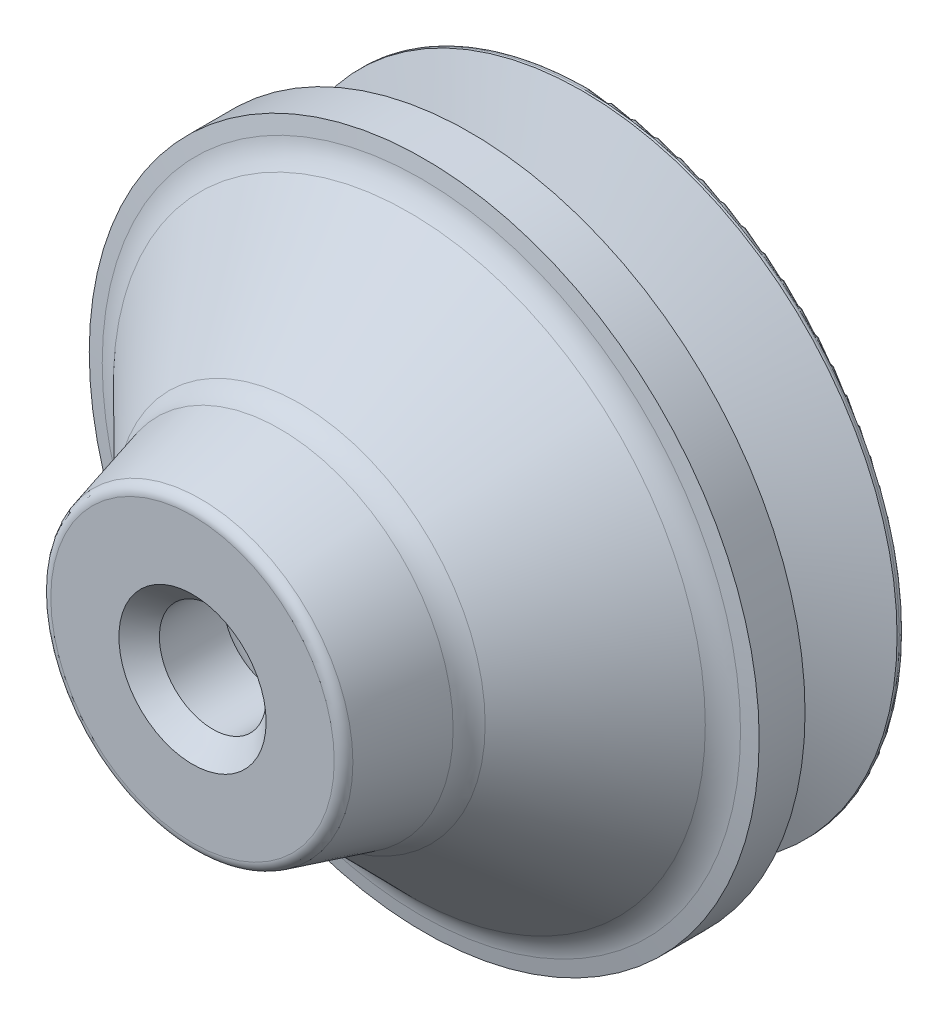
ISO-10303-21;
HEADER;
FILE_DESCRIPTION(('STEP AP214'),'2;1');
FILE_NAME('part.step','',(''),(''),'','','');
FILE_SCHEMA(('AUTOMOTIVE_DESIGN { 1 0 10303 214 1 1 1 1 }'));
ENDSEC;
DATA;
#1=APPLICATION_CONTEXT('core data for automotive mechanical design processes');
#2=APPLICATION_PROTOCOL_DEFINITION('international standard','automotive_design',2000,#1);
#3=PRODUCT_CONTEXT('',#1,'mechanical');
#4=PRODUCT('Part','Part','',(#3));
#5=PRODUCT_RELATED_PRODUCT_CATEGORY('part','',(#4));
#6=PRODUCT_DEFINITION_FORMATION('','',#4);
#7=PRODUCT_DEFINITION_CONTEXT('part definition',#1,'design');
#8=PRODUCT_DEFINITION('design','',#6,#7);
#9=PRODUCT_DEFINITION_SHAPE('','',#8);
#10=(LENGTH_UNIT() NAMED_UNIT(*) SI_UNIT(.MILLI.,.METRE.));
#11=(NAMED_UNIT(*) PLANE_ANGLE_UNIT() SI_UNIT($,.RADIAN.));
#12=(NAMED_UNIT(*) SI_UNIT($,.STERADIAN.) SOLID_ANGLE_UNIT());
#13=UNCERTAINTY_MEASURE_WITH_UNIT(LENGTH_MEASURE(1.E-05),#10,'distance_accuracy_value','');
#14=(GEOMETRIC_REPRESENTATION_CONTEXT(3) GLOBAL_UNCERTAINTY_ASSIGNED_CONTEXT((#13)) GLOBAL_UNIT_ASSIGNED_CONTEXT((#10,
#11,#12)) REPRESENTATION_CONTEXT('',''));
#15=CARTESIAN_POINT('',(0.,0.,0.));
#16=DIRECTION('',(0.,0.,1.));
#17=DIRECTION('',(1.,0.,0.));
#18=AXIS2_PLACEMENT_3D('',#15,#16,#17);
#19=CARTESIAN_POINT('',(0.,0.,-27.432));
#20=DIRECTION('',(0.,0.,-1.));
#21=DIRECTION('',(-1.,0.,0.));
#22=AXIS2_PLACEMENT_3D('',#19,#20,#21);
#23=CONICAL_SURFACE('',#22,20.193,1.2189284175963);
#24=CARTESIAN_POINT('',(0.,0.,-24.9983909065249));
#25=DIRECTION('',(0.,0.,1.));
#26=DIRECTION('',(1.,0.,0.));
#27=AXIS2_PLACEMENT_3D('',#24,#25,#26);
#28=CIRCLE('',#27,13.5645628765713);
#29=CARTESIAN_POINT('',(13.5645628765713,0.,-24.9983909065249));
#30=VERTEX_POINT('',#29);
#31=EDGE_CURVE('E10',#30,#30,#28,.T.);
#32=ORIENTED_EDGE('',*,*,#31,.T.);
#33=EDGE_LOOP('',(#32));
#34=FACE_BOUND('',#33,.T.);
#35=CARTESIAN_POINT('',(0.,0.,-27.432));
#36=DIRECTION('',(0.,0.,1.));
#37=DIRECTION('',(1.,0.,0.));
#38=AXIS2_PLACEMENT_3D('',#35,#36,#37);
#39=CIRCLE('',#38,20.193);
#40=CARTESIAN_POINT('',(20.193,0.,-27.432));
#41=VERTEX_POINT('',#40);
#42=EDGE_CURVE('E439',#41,#41,#39,.T.);
#43=ORIENTED_EDGE('',*,*,#42,.F.);
#44=EDGE_LOOP('',(#43));
#45=FACE_BOUND('',#44,.T.);
#46=ADVANCED_FACE('F16',(#34,#45),#23,.F.);
#47=CARTESIAN_POINT('',(0.,0.,-1.39700000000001));
#48=DIRECTION('',(0.,0.,1.));
#49=DIRECTION('',(1.,0.,0.));
#50=AXIS2_PLACEMENT_3D('',#47,#48,#49);
#51=CONICAL_SURFACE('',#50,3.683,0.785398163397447);
#52=CARTESIAN_POINT('',(0.,0.,0.));
#53=DIRECTION('',(0.,0.,1.));
#54=DIRECTION('',(1.,0.,0.));
#55=AXIS2_PLACEMENT_3D('',#52,#53,#54);
#56=CIRCLE('',#55,5.08);
#57=CARTESIAN_POINT('',(5.08,0.,0.));
#58=VERTEX_POINT('',#57);
#59=EDGE_CURVE('E423',#58,#58,#56,.T.);
#60=ORIENTED_EDGE('',*,*,#59,.T.);
#61=EDGE_LOOP('',(#60));
#62=FACE_BOUND('',#61,.T.);
#63=CARTESIAN_POINT('',(0.,0.,-1.39700000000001));
#64=DIRECTION('',(0.,0.,1.));
#65=DIRECTION('',(1.,0.,0.));
#66=AXIS2_PLACEMENT_3D('',#63,#64,#65);
#67=CIRCLE('',#66,3.683);
#68=CARTESIAN_POINT('',(3.683,0.,-1.39700000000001));
#69=VERTEX_POINT('',#68);
#70=EDGE_CURVE('E1229',#69,#69,#67,.T.);
#71=ORIENTED_EDGE('',*,*,#70,.F.);
#72=EDGE_LOOP('',(#71));
#73=FACE_BOUND('',#72,.T.);
#74=ADVANCED_FACE('F608',(#62,#73),#51,.F.);
#75=CARTESIAN_POINT('',(0.,0.,0.));
#76=DIRECTION('',(0.,0.,1.));
#77=DIRECTION('',(1.,0.,0.));
#78=AXIS2_PLACEMENT_3D('',#75,#76,#77);
#79=PLANE('',#78);
#80=CARTESIAN_POINT('',(0.,0.,0.));
#81=DIRECTION('',(0.,0.,1.));
#82=DIRECTION('',(1.,0.,0.));
#83=AXIS2_PLACEMENT_3D('',#80,#81,#82);
#84=CIRCLE('',#83,9.779);
#85=CARTESIAN_POINT('',(9.779,0.,0.));
#86=VERTEX_POINT('',#85);
#87=EDGE_CURVE('E492',#86,#86,#84,.T.);
#88=ORIENTED_EDGE('',*,*,#87,.T.);
#89=EDGE_LOOP('',(#88));
#90=FACE_BOUND('',#89,.T.);
#91=ORIENTED_EDGE('',*,*,#59,.F.);
#92=EDGE_LOOP('',(#91));
#93=FACE_BOUND('',#92,.T.);
#94=ADVANCED_FACE('F615',(#90,#93),#79,.T.);
#95=CARTESIAN_POINT('',(0.,0.,-27.432));
#96=DIRECTION('',(0.,0.,1.));
#97=DIRECTION('',(1.,0.,0.));
#98=AXIS2_PLACEMENT_3D('',#95,#96,#97);
#99=PLANE('',#98);
#100=CARTESIAN_POINT('',(0.,0.,-27.432));
#101=DIRECTION('',(0.,0.,1.));
#102=DIRECTION('',(1.,0.,0.));
#103=AXIS2_PLACEMENT_3D('',#100,#101,#102);
#104=CIRCLE('',#103,21.336);
#105=CARTESIAN_POINT('',(21.336,0.,-27.432));
#106=VERTEX_POINT('',#105);
#107=EDGE_CURVE('E500',#106,#106,#104,.F.);
#108=ORIENTED_EDGE('',*,*,#107,.T.);
#109=EDGE_LOOP('',(#108));
#110=FACE_BOUND('',#109,.T.);
#111=ORIENTED_EDGE('',*,*,#42,.T.);
#112=EDGE_LOOP('',(#111));
#113=FACE_BOUND('',#112,.T.);
#114=ADVANCED_FACE('F727',(#110,#113),#99,.F.);
#115=CARTESIAN_POINT('',(0.,0.,-27.432));
#116=DIRECTION('',(0.,0.,1.));
#117=DIRECTION('',(1.,0.,0.));
#118=AXIS2_PLACEMENT_3D('',#115,#116,#117);
#119=CYLINDRICAL_SURFACE('',#118,23.114);
#120=CARTESIAN_POINT('',(0.,0.,-15.9874816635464));
#121=DIRECTION('',(0.,0.,1.));
#122=DIRECTION('',(1.,0.,0.));
#123=AXIS2_PLACEMENT_3D('',#120,#121,#122);
#124=CIRCLE('',#123,23.114);
#125=CARTESIAN_POINT('',(23.114,0.,-15.9874816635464));
#126=VERTEX_POINT('',#125);
#127=EDGE_CURVE('E488',#126,#126,#124,.T.);
#128=ORIENTED_EDGE('',*,*,#127,.F.);
#129=EDGE_LOOP('',(#128));
#130=FACE_BOUND('',#129,.T.);
#131=CARTESIAN_POINT('',(0.,0.,-19.1516));
#132=DIRECTION('',(0.,0.,1.));
#133=DIRECTION('',(1.,0.,0.));
#134=AXIS2_PLACEMENT_3D('',#131,#132,#133);
#135=CIRCLE('',#134,23.114);
#136=CARTESIAN_POINT('',(23.114,0.,-19.1516));
#137=VERTEX_POINT('',#136);
#138=EDGE_CURVE('E447',#137,#137,#135,.T.);
#139=ORIENTED_EDGE('',*,*,#138,.T.);
#140=EDGE_LOOP('',(#139));
#141=FACE_BOUND('',#140,.T.);
#142=ADVANCED_FACE('F718',(#130,#141),#119,.T.);
#143=CARTESIAN_POINT('',(0.,0.,-0.761883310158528));
#144=DIRECTION('',(0.,0.,1.));
#145=DIRECTION('',(1.,0.,0.));
#146=AXIS2_PLACEMENT_3D('',#143,#144,#145);
#147=TOROIDAL_SURFACE('',#146,9.76566501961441,0.762);
#148=CARTESIAN_POINT('',(0.,0.,-0.564663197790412));
#149=DIRECTION('',(0.,0.,1.));
#150=DIRECTION('',(1.,0.,0.));
#151=AXIS2_PLACEMENT_3D('',#148,#149,#150);
#152=CIRCLE('',#151,10.5017004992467);
#153=CARTESIAN_POINT('',(10.5017004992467,0.,-0.564663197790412));
#154=VERTEX_POINT('',#153);
#155=EDGE_CURVE('E468',#154,#154,#152,.T.);
#156=ORIENTED_EDGE('',*,*,#155,.T.);
#157=EDGE_LOOP('',(#156));
#158=FACE_BOUND('',#157,.T.);
#159=ORIENTED_EDGE('',*,*,#87,.F.);
#160=EDGE_LOOP('',(#159));
#161=FACE_BOUND('',#160,.T.);
#162=ADVANCED_FACE('F709',(#158,#161),#147,.T.);
#163=CARTESIAN_POINT('',(0.,0.,-15.790647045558));
#164=DIRECTION('',(0.,0.,-1.));
#165=DIRECTION('',(-1.,0.,0.));
#166=AXIS2_PLACEMENT_3D('',#163,#164,#165);
#167=CONICAL_SURFACE('',#166,22.0218,1.39249177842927);
#168=ORIENTED_EDGE('',*,*,#127,.T.);
#169=EDGE_LOOP('',(#168));
#170=FACE_BOUND('',#169,.T.);
#171=CARTESIAN_POINT('',(0.,0.,-15.790647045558));
#172=DIRECTION('',(0.,0.,1.));
#173=DIRECTION('',(1.,0.,0.));
#174=AXIS2_PLACEMENT_3D('',#171,#172,#173);
#175=CIRCLE('',#174,22.0218);
#176=CARTESIAN_POINT('',(22.0218,0.,-15.790647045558));
#177=VERTEX_POINT('',#176);
#178=EDGE_CURVE('E484',#177,#177,#175,.T.);
#179=ORIENTED_EDGE('',*,*,#178,.F.);
#180=EDGE_LOOP('',(#179));
#181=FACE_BOUND('',#180,.T.);
#182=ADVANCED_FACE('F700',(#170,#181),#167,.T.);
#183=CARTESIAN_POINT('',(0.,0.,-12.790970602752));
#184=DIRECTION('',(0.,0.,1.));
#185=DIRECTION('',(1.,0.,0.));
#186=AXIS2_PLACEMENT_3D('',#183,#184,#185);
#187=TOROIDAL_SURFACE('',#186,22.5623971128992,3.048);
#188=ORIENTED_EDGE('',*,*,#178,.T.);
#189=EDGE_LOOP('',(#188));
#190=FACE_BOUND('',#189,.T.);
#191=CARTESIAN_POINT('',(0.,0.,-14.9606));
#192=DIRECTION('',(0.,0.,1.));
#193=DIRECTION('',(1.,0.,0.));
#194=AXIS2_PLACEMENT_3D('',#191,#192,#193);
#195=CIRCLE('',#194,20.4216);
#196=CARTESIAN_POINT('',(20.4216,0.,-14.9606));
#197=VERTEX_POINT('',#196);
#198=EDGE_CURVE('E480',#197,#197,#195,.T.);
#199=ORIENTED_EDGE('',*,*,#198,.F.);
#200=EDGE_LOOP('',(#199));
#201=FACE_BOUND('',#200,.T.);
#202=ADVANCED_FACE('F690',(#190,#201),#187,.F.);
#203=CARTESIAN_POINT('',(0.,0.,-7.4168));
#204=DIRECTION('',(0.,0.,-1.));
#205=DIRECTION('',(-1.,0.,0.));
#206=AXIS2_PLACEMENT_3D('',#203,#204,#205);
#207=CONICAL_SURFACE('',#206,12.7762,0.792087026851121);
#208=ORIENTED_EDGE('',*,*,#198,.T.);
#209=EDGE_LOOP('',(#208));
#210=FACE_BOUND('',#209,.T.);
#211=CARTESIAN_POINT('',(0.,0.,-7.4168));
#212=DIRECTION('',(0.,0.,1.));
#213=DIRECTION('',(1.,0.,0.));
#214=AXIS2_PLACEMENT_3D('',#211,#212,#213);
#215=CIRCLE('',#214,12.7762);
#216=CARTESIAN_POINT('',(12.7762,0.,-7.4168));
#217=VERTEX_POINT('',#216);
#218=EDGE_CURVE('E476',#217,#217,#215,.T.);
#219=ORIENTED_EDGE('',*,*,#218,.F.);
#220=EDGE_LOOP('',(#219));
#221=FACE_BOUND('',#220,.T.);
#222=ADVANCED_FACE('F680',(#210,#221),#207,.T.);
#223=CARTESIAN_POINT('',(0.,0.,-5.24033685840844));
#224=DIRECTION('',(0.,0.,1.));
#225=DIRECTION('',(1.,0.,0.));
#226=AXIS2_PLACEMENT_3D('',#223,#224,#225);
#227=TOROIDAL_SURFACE('',#226,14.9100491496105,3.048);
#228=ORIENTED_EDGE('',*,*,#218,.T.);
#229=EDGE_LOOP('',(#228));
#230=FACE_BOUND('',#229,.T.);
#231=CARTESIAN_POINT('',(0.,0.,-6.0198));
#232=DIRECTION('',(0.,0.,1.));
#233=DIRECTION('',(1.,0.,0.));
#234=AXIS2_PLACEMENT_3D('',#231,#232,#233);
#235=CIRCLE('',#234,11.9634);
#236=CARTESIAN_POINT('',(11.9634,0.,-6.0198));
#237=VERTEX_POINT('',#236);
#238=EDGE_CURVE('E472',#237,#237,#235,.T.);
#239=ORIENTED_EDGE('',*,*,#238,.F.);
#240=EDGE_LOOP('',(#239));
#241=FACE_BOUND('',#240,.T.);
#242=ADVANCED_FACE('F671',(#230,#241),#227,.F.);
#243=CARTESIAN_POINT('',(0.,0.,-0.564663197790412));
#244=DIRECTION('',(0.,0.,-1.));
#245=DIRECTION('',(-1.,0.,0.));
#246=AXIS2_PLACEMENT_3D('',#243,#244,#245);
#247=CONICAL_SURFACE('',#246,10.5017004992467,0.261799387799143);
#248=ORIENTED_EDGE('',*,*,#238,.T.);
#249=EDGE_LOOP('',(#248));
#250=FACE_BOUND('',#249,.T.);
#251=ORIENTED_EDGE('',*,*,#155,.F.);
#252=EDGE_LOOP('',(#251));
#253=FACE_BOUND('',#252,.T.);
#254=ADVANCED_FACE('F663',(#250,#253),#247,.T.);
#255=CARTESIAN_POINT('',(0.,0.,-21.4300030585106));
#256=DIRECTION('',(0.,0.,1.));
#257=DIRECTION('',(1.,0.,0.));
#258=AXIS2_PLACEMENT_3D('',#255,#256,#257);
#259=TOROIDAL_SURFACE('',#258,21.3009957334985,2.286);
#260=CARTESIAN_POINT('',(-0.396875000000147,-21.0457107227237,-19.1578846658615));
#261=CARTESIAN_POINT('',(-0.396875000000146,-20.9180464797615,-19.172021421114));
#262=CARTESIAN_POINT('',(-0.396875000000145,-20.7914829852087,-19.1969491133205));
#263=CARTESIAN_POINT('',(-0.396875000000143,-20.5442326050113,-19.2677219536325));
#264=CARTESIAN_POINT('',(-0.396875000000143,-20.4235529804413,-19.313592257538));
#265=CARTESIAN_POINT('',(-0.396875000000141,-20.1916561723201,-19.4249290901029));
#266=CARTESIAN_POINT('',(-0.39687500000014,-20.080434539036,-19.490386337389));
#267=CARTESIAN_POINT('',(-0.396875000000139,-19.8705918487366,-19.6390288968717));
#268=CARTESIAN_POINT('',(-0.396875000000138,-19.7719676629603,-19.7222097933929));
#269=CARTESIAN_POINT('',(-0.396875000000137,-19.5900825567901,-19.9039511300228));
#270=CARTESIAN_POINT('',(-0.396875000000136,-19.5068218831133,-20.0025118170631));
#271=CARTESIAN_POINT('',(-0.396875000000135,-19.3580300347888,-20.2122187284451));
#272=CARTESIAN_POINT('',(-0.396875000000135,-19.292499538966,-20.3233654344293));
#273=CARTESIAN_POINT('',(-0.396875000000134,-19.1810469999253,-20.5550606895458));
#274=CARTESIAN_POINT('',(-0.396875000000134,-19.1351207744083,-20.6756072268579));
#275=CARTESIAN_POINT('',(-0.396875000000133,-19.0641623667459,-20.9227002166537));
#276=CARTESIAN_POINT('',(-0.396875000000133,-19.0391301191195,-21.0492466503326));
#277=CARTESIAN_POINT('',(-0.396875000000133,-19.0106737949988,-21.304723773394));
#278=CARTESIAN_POINT('',(-0.396875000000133,-19.0072459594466,-21.4336540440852));
#279=CARTESIAN_POINT('',(-0.396875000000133,-19.0220858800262,-21.6902596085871));
#280=CARTESIAN_POINT('',(-0.396875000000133,-19.0403535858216,-21.8179349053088));
#281=CARTESIAN_POINT('',(-0.396875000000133,-19.0980634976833,-22.0683990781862));
#282=CARTESIAN_POINT('',(-0.396875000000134,-19.1375045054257,-22.1911882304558));
#283=CARTESIAN_POINT('',(-0.396875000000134,-19.2364393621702,-22.4284032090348));
#284=CARTESIAN_POINT('',(-0.396875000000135,-19.2959332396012,-22.5428290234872));
#285=CARTESIAN_POINT('',(-0.396875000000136,-19.4332902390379,-22.7600812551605));
#286=CARTESIAN_POINT('',(-0.396875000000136,-19.5111551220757,-22.8629065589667));
#287=CARTESIAN_POINT('',(-0.396875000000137,-19.683039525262,-23.0540284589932));
#288=CARTESIAN_POINT('',(-0.396875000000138,-19.7770590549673,-23.1423250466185));
#289=CARTESIAN_POINT('',(-0.39687500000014,-19.9786031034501,-23.3019012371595));
#290=CARTESIAN_POINT('',(-0.39687500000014,-20.0861302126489,-23.3731775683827));
#291=CARTESIAN_POINT('',(-0.396875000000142,-20.311622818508,-23.4966701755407));
#292=CARTESIAN_POINT('',(-0.396875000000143,-20.4295883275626,-23.5488864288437));
#293=CARTESIAN_POINT('',(-0.396875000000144,-20.6726321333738,-23.6327859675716));
#294=CARTESIAN_POINT('',(-0.396875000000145,-20.797711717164,-23.6644655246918));
#295=CARTESIAN_POINT('',(-0.396875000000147,-21.0514139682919,-23.7063779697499));
#296=CARTESIAN_POINT('',(-0.396875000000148,-21.1800366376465,-23.7166108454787));
#297=CARTESIAN_POINT('',(-0.39687500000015,-21.4371856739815,-23.7153393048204));
#298=CARTESIAN_POINT('',(-0.396875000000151,-21.5657120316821,-23.7038330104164));
#299=CARTESIAN_POINT('',(-0.396875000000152,-21.8190086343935,-23.6594053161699));
#300=CARTESIAN_POINT('',(-0.396875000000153,-21.9437788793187,-23.6264839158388));
#301=CARTESIAN_POINT('',(-0.396875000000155,-22.1860167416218,-23.5401609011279));
#302=CARTESIAN_POINT('',(-0.396875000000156,-22.3034845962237,-23.4867599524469));
#303=CARTESIAN_POINT('',(-0.396875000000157,-22.5277862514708,-23.3609925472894));
#304=CARTESIAN_POINT('',(-0.396875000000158,-22.6346200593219,-23.2886261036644));
#305=CARTESIAN_POINT('',(-0.396875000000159,-22.8346069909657,-23.1269910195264));
#306=CARTESIAN_POINT('',(-0.39687500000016,-22.9277617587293,-23.0377244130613));
#307=CARTESIAN_POINT('',(-0.396875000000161,-23.0977597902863,-22.8448167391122));
#308=CARTESIAN_POINT('',(-0.396875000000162,-23.1746030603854,-22.7411756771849));
#309=CARTESIAN_POINT('',(-0.396875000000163,-23.3097845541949,-22.5224778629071));
#310=CARTESIAN_POINT('',(-0.396875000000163,-23.3681255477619,-22.4074228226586));
#311=CARTESIAN_POINT('',(-0.396875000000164,-23.4646605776,-22.1691504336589));
#312=CARTESIAN_POINT('',(-0.396875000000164,-23.5028546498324,-22.0459330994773));
#313=CARTESIAN_POINT('',(-0.396875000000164,-23.5580072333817,-21.7948501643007));
#314=CARTESIAN_POINT('',(-0.396875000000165,-23.5749683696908,-21.6669851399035));
#315=CARTESIAN_POINT('',(-0.396875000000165,-23.5871818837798,-21.4102222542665));
#316=CARTESIAN_POINT('',(-0.396875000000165,-23.5824342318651,-21.2813243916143));
#317=CARTESIAN_POINT('',(-0.396875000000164,-23.5513659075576,-21.0261629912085));
#318=CARTESIAN_POINT('',(-0.396875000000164,-23.5250464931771,-20.8998993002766));
#319=CARTESIAN_POINT('',(-0.396875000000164,-23.4515838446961,-20.6535822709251));
#320=CARTESIAN_POINT('',(-0.396875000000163,-23.404440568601,-20.5335289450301));
#321=CARTESIAN_POINT('',(-0.396875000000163,-23.290666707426,-20.3030349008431));
#322=CARTESIAN_POINT('',(-0.396875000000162,-23.2240352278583,-20.1925946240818));
#323=CARTESIAN_POINT('',(-0.396875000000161,-23.0731808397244,-19.9844709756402));
#324=CARTESIAN_POINT('',(-0.396875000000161,-22.9889586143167,-19.8867871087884));
#325=CARTESIAN_POINT('',(-0.396875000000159,-22.8053137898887,-19.7069423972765));
#326=CARTESIAN_POINT('',(-0.396875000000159,-22.70589121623,-19.6247815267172));
#327=CARTESIAN_POINT('',(-0.396875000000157,-22.494636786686,-19.4782942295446));
#328=CARTESIAN_POINT('',(-0.396875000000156,-22.3828018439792,-19.4139722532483));
#329=CARTESIAN_POINT('',(-0.396875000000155,-22.1498617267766,-19.3049800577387));
#330=CARTESIAN_POINT('',(-0.396875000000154,-22.0287508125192,-19.2603221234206));
#331=CARTESIAN_POINT('',(-0.396875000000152,-21.7808484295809,-19.1920258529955));
#332=CARTESIAN_POINT('',(-0.396875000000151,-21.6540639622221,-19.1683623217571));
#333=CARTESIAN_POINT('',(-0.39687500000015,-21.446421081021,-19.1474555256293));
#334=CARTESIAN_POINT('',(-0.396875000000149,-21.3661678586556,-19.1436326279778));
#335=CARTESIAN_POINT('',(-0.396875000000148,-21.2057033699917,-19.1444299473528));
#336=CARTESIAN_POINT('',(-0.396875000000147,-21.1254921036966,-19.149050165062));
#337=CARTESIAN_POINT('',(-0.396875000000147,-21.0457107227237,-19.1578846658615));
#338=B_SPLINE_CURVE_WITH_KNOTS('',3,(#260,#261,#262,#263,#264,#265,#266,#267,#268,#269,#270,
#271,#272,#273,#274,#275,#276,#277,#278,#279,#280,#281,#282,#283,#284,#285,#286,#287,#288,#289,
#290,#291,#292,#293,#294,#295,#296,#297,#298,#299,#300,#301,#302,#303,#304,#305,#306,#307,#308,
#309,#310,#311,#312,#313,#314,#315,#316,#317,#318,#319,#320,#321,#322,#323,#324,#325,#326,#327,
#328,#329,#330,#331,#332,#333,#334,#335,#336,#337),.UNSPECIFIED.,.T.,.F.,(4,2,2,2,2,2,2,2,2,2,2,
2,2,2,2,2,2,2,2,2,2,2,2,2,2,2,2,2,2,2,2,2,2,2,2,2,2,2,4),(0.,0.385040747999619,
0.770545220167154,1.15586730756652,1.54109350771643,1.92632589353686,2.31157302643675,
2.69673793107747,3.08190162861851,3.46699830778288,3.85209409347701,4.23716808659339,
4.62224262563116,5.00735409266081,5.39246578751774,5.77765145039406,6.16283757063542,
6.54809359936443,6.93334984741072,7.31863937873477,7.70392891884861,8.08920593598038,
8.47448269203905,8.8597131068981,9.24494337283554,9.63011594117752,10.0152878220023,
10.4004120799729,10.7855368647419,11.1706391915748,11.5557422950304,11.9408630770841,
12.3259689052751,12.7110740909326,13.0962752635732,13.4817167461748,13.8666950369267,
14.1073190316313,14.3479430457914),.UNSPECIFIED.);
#339=CARTESIAN_POINT('',(-0.396875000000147,-21.1110519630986,-19.1516));
#340=VERTEX_POINT('',#339);
#341=CARTESIAN_POINT('',(-0.39687500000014,-19.9858598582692,-19.5574214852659));
#342=VERTEX_POINT('',#341);
#343=EDGE_CURVE('E246',#340,#342,#338,.T.);
#344=ORIENTED_EDGE('',*,*,#343,.F.);
#345=CARTESIAN_POINT('',(0.,0.,-19.1516));
#346=DIRECTION('',(0.,0.,1.));
#347=DIRECTION('',(1.,0.,0.));
#348=AXIS2_PLACEMENT_3D('',#345,#346,#347);
#349=CIRCLE('',#348,21.1147821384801);
#350=CARTESIAN_POINT('',(0.396874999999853,-21.1110519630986,-19.1516));
#351=VERTEX_POINT('',#350);
#352=EDGE_CURVE('E962',#340,#351,#349,.T.);
#353=ORIENTED_EDGE('',*,*,#352,.T.);
#354=CARTESIAN_POINT('',(0.396874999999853,-21.0457107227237,-19.1578846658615));
#355=CARTESIAN_POINT('',(0.396874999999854,-20.9180464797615,-19.172021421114));
#356=CARTESIAN_POINT('',(0.396874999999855,-20.7914829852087,-19.1969491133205));
#357=CARTESIAN_POINT('',(0.396874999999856,-20.5442326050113,-19.2677219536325));
#358=CARTESIAN_POINT('',(0.396874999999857,-20.4235529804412,-19.313592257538));
#359=CARTESIAN_POINT('',(0.396874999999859,-20.1916561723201,-19.4249290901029));
#360=CARTESIAN_POINT('',(0.39687499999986,-20.080434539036,-19.490386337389));
#361=CARTESIAN_POINT('',(0.396874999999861,-19.8705918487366,-19.6390288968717));
#362=CARTESIAN_POINT('',(0.396874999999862,-19.7719676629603,-19.7222097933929));
#363=CARTESIAN_POINT('',(0.396874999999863,-19.5900825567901,-19.9039511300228));
#364=CARTESIAN_POINT('',(0.396874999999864,-19.5068218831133,-20.0025118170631));
#365=CARTESIAN_POINT('',(0.396874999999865,-19.3580300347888,-20.2122187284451));
#366=CARTESIAN_POINT('',(0.396874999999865,-19.292499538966,-20.3233654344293));
#367=CARTESIAN_POINT('',(0.396874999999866,-19.1810469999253,-20.5550606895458));
#368=CARTESIAN_POINT('',(0.396874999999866,-19.1351207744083,-20.6756072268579));
#369=CARTESIAN_POINT('',(0.396874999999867,-19.0641623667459,-20.9227002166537));
#370=CARTESIAN_POINT('',(0.396874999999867,-19.0391301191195,-21.0492466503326));
#371=CARTESIAN_POINT('',(0.396874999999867,-19.0106737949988,-21.304723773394));
#372=CARTESIAN_POINT('',(0.396874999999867,-19.0072459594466,-21.4336540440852));
#373=CARTESIAN_POINT('',(0.396874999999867,-19.0220858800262,-21.6902596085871));
#374=CARTESIAN_POINT('',(0.396874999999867,-19.0403535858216,-21.8179349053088));
#375=CARTESIAN_POINT('',(0.396874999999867,-19.0980634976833,-22.0683990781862));
#376=CARTESIAN_POINT('',(0.396874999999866,-19.1375045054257,-22.1911882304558));
#377=CARTESIAN_POINT('',(0.396874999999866,-19.2364393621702,-22.4284032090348));
#378=CARTESIAN_POINT('',(0.396874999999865,-19.2959332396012,-22.5428290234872));
#379=CARTESIAN_POINT('',(0.396874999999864,-19.433290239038,-22.7600812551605));
#380=CARTESIAN_POINT('',(0.396874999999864,-19.5111551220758,-22.8629065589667));
#381=CARTESIAN_POINT('',(0.396874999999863,-19.683039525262,-23.0540284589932));
#382=CARTESIAN_POINT('',(0.396874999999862,-19.7770590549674,-23.1423250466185));
#383=CARTESIAN_POINT('',(0.39687499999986,-19.9786031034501,-23.3019012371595));
#384=CARTESIAN_POINT('',(0.39687499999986,-20.0861302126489,-23.3731775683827));
#385=CARTESIAN_POINT('',(0.396874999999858,-20.311622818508,-23.4966701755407));
#386=CARTESIAN_POINT('',(0.396874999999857,-20.4295883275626,-23.5488864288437));
#387=CARTESIAN_POINT('',(0.396874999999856,-20.6726321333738,-23.6327859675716));
#388=CARTESIAN_POINT('',(0.396874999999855,-20.797711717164,-23.6644655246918));
#389=CARTESIAN_POINT('',(0.396874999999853,-21.0514139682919,-23.7063779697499));
#390=CARTESIAN_POINT('',(0.396874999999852,-21.1800366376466,-23.7166108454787));
#391=CARTESIAN_POINT('',(0.39687499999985,-21.4371856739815,-23.7153393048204));
#392=CARTESIAN_POINT('',(0.396874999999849,-21.5657120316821,-23.7038330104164));
#393=CARTESIAN_POINT('',(0.396874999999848,-21.8190086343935,-23.6594053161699));
#394=CARTESIAN_POINT('',(0.396874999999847,-21.9437788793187,-23.6264839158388));
#395=CARTESIAN_POINT('',(0.396874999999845,-22.1860167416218,-23.5401609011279));
#396=CARTESIAN_POINT('',(0.396874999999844,-22.3034845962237,-23.4867599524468));
#397=CARTESIAN_POINT('',(0.396874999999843,-22.5277862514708,-23.3609925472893));
#398=CARTESIAN_POINT('',(0.396874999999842,-22.634620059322,-23.2886261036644));
#399=CARTESIAN_POINT('',(0.39687499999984,-22.8346069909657,-23.1269910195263));
#400=CARTESIAN_POINT('',(0.39687499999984,-22.9277617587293,-23.0377244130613));
#401=CARTESIAN_POINT('',(0.396874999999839,-23.0977597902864,-22.8448167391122));
#402=CARTESIAN_POINT('',(0.396874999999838,-23.1746030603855,-22.7411756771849));
#403=CARTESIAN_POINT('',(0.396874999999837,-23.3097845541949,-22.5224778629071));
#404=CARTESIAN_POINT('',(0.396874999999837,-23.3681255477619,-22.4074228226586));
#405=CARTESIAN_POINT('',(0.396874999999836,-23.4646605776,-22.1691504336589));
#406=CARTESIAN_POINT('',(0.396874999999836,-23.5028546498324,-22.0459330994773));
#407=CARTESIAN_POINT('',(0.396874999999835,-23.5580072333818,-21.7948501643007));
#408=CARTESIAN_POINT('',(0.396874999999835,-23.5749683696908,-21.6669851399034));
#409=CARTESIAN_POINT('',(0.396874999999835,-23.5871818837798,-21.4102222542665));
#410=CARTESIAN_POINT('',(0.396874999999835,-23.5824342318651,-21.2813243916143));
#411=CARTESIAN_POINT('',(0.396874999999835,-23.5513659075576,-21.0261629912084));
#412=CARTESIAN_POINT('',(0.396874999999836,-23.5250464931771,-20.8998993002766));
#413=CARTESIAN_POINT('',(0.396874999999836,-23.4515838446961,-20.6535822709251));
#414=CARTESIAN_POINT('',(0.396874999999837,-23.404440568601,-20.5335289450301));
#415=CARTESIAN_POINT('',(0.396874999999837,-23.290666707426,-20.303034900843));
#416=CARTESIAN_POINT('',(0.396874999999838,-23.2240352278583,-20.1925946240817));
#417=CARTESIAN_POINT('',(0.396874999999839,-23.0731808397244,-19.9844709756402));
#418=CARTESIAN_POINT('',(0.396874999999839,-22.9889586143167,-19.8867871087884));
#419=CARTESIAN_POINT('',(0.396874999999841,-22.8053137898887,-19.7069423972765));
#420=CARTESIAN_POINT('',(0.396874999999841,-22.70589121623,-19.6247815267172));
#421=CARTESIAN_POINT('',(0.396874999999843,-22.494636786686,-19.4782942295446));
#422=CARTESIAN_POINT('',(0.396874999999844,-22.3828018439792,-19.4139722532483));
#423=CARTESIAN_POINT('',(0.396874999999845,-22.1498617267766,-19.3049800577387));
#424=CARTESIAN_POINT('',(0.396874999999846,-22.0287508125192,-19.2603221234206));
#425=CARTESIAN_POINT('',(0.396874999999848,-21.7808484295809,-19.1920258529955));
#426=CARTESIAN_POINT('',(0.396874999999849,-21.6540639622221,-19.1683623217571));
#427=CARTESIAN_POINT('',(0.39687499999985,-21.446421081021,-19.1474555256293));
#428=CARTESIAN_POINT('',(0.396874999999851,-21.3661678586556,-19.1436326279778));
#429=CARTESIAN_POINT('',(0.396874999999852,-21.2057033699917,-19.1444299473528));
#430=CARTESIAN_POINT('',(0.396874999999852,-21.1254921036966,-19.149050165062));
#431=CARTESIAN_POINT('',(0.396874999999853,-21.0457107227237,-19.1578846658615));
#432=B_SPLINE_CURVE_WITH_KNOTS('',3,(#354,#355,#356,#357,#358,#359,#360,#361,#362,#363,#364,
#365,#366,#367,#368,#369,#370,#371,#372,#373,#374,#375,#376,#377,#378,#379,#380,#381,#382,#383,
#384,#385,#386,#387,#388,#389,#390,#391,#392,#393,#394,#395,#396,#397,#398,#399,#400,#401,#402,
#403,#404,#405,#406,#407,#408,#409,#410,#411,#412,#413,#414,#415,#416,#417,#418,#419,#420,#421,
#422,#423,#424,#425,#426,#427,#428,#429,#430,#431),.UNSPECIFIED.,.T.,.F.,(4,2,2,2,2,2,2,2,2,2,2,
2,2,2,2,2,2,2,2,2,2,2,2,2,2,2,2,2,2,2,2,2,2,2,2,2,2,2,4),(0.,0.385040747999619,
0.770545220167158,1.15586730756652,1.54109350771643,1.92632589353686,2.31157302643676,
2.69673793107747,3.08190162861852,3.46699830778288,3.85209409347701,4.23716808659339,
4.62224262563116,5.00735409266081,5.39246578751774,5.77765145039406,6.16283757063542,
6.54809359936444,6.93334984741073,7.31863937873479,7.70392891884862,8.08920593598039,
8.47448269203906,8.85971310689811,9.24494337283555,9.63011594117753,10.0152878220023,
10.4004120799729,10.7855368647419,11.1706391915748,11.5557422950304,11.9408630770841,
12.3259689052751,12.7110740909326,13.0962752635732,13.4817167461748,13.8666950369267,
14.1073190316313,14.3479430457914),.UNSPECIFIED.);
#433=CARTESIAN_POINT('',(0.39687499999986,-19.9858598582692,-19.5574214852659));
#434=VERTEX_POINT('',#433);
#435=EDGE_CURVE('E237',#351,#434,#432,.T.);
#436=ORIENTED_EDGE('',*,*,#435,.T.);
#437=CARTESIAN_POINT('',(0.,0.,-19.5574214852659));
#438=DIRECTION('',(0.,0.,1.));
#439=DIRECTION('',(1.,0.,0.));
#440=AXIS2_PLACEMENT_3D('',#437,#438,#439);
#441=CIRCLE('',#440,19.9898);
#442=CARTESIAN_POINT('',(0.396875,19.9858598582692,-19.5574214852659));
#443=VERTEX_POINT('',#442);
#444=EDGE_CURVE('E463',#434,#443,#441,.T.);
#445=ORIENTED_EDGE('',*,*,#444,.T.);
#446=CARTESIAN_POINT('',(0.396875,20.1513476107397,-19.4518536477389));
#447=CARTESIAN_POINT('',(0.396875,20.0402186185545,-19.5162134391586));
#448=CARTESIAN_POINT('',(0.396875,19.9344430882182,-19.5900035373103));
#449=CARTESIAN_POINT('',(0.396875,19.736694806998,-19.7543575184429));
#450=CARTESIAN_POINT('',(0.396875,19.6447388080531,-19.8449414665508));
#451=CARTESIAN_POINT('',(0.396875,19.4773791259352,-20.0402310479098));
#452=CARTESIAN_POINT('',(0.396875,19.4019677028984,-20.144930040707));
#453=CARTESIAN_POINT('',(0.396875,19.2698175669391,-20.3654759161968));
#454=CARTESIAN_POINT('',(0.396875,19.2130742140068,-20.4813200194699));
#455=CARTESIAN_POINT('',(0.396875,19.1198451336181,-20.7208867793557));
#456=CARTESIAN_POINT('',(0.396875,19.0833585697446,-20.8446091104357));
#457=CARTESIAN_POINT('',(0.396875,19.0316769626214,-21.096428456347));
#458=CARTESIAN_POINT('',(0.396875,19.0164827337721,-21.2245256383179));
#459=CARTESIAN_POINT('',(0.396875,19.0078209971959,-21.4814300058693));
#460=CARTESIAN_POINT('',(0.396875,19.0143496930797,-21.6102370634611));
#461=CARTESIAN_POINT('',(0.396875,19.0489398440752,-21.8649264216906));
#462=CARTESIAN_POINT('',(0.396875,19.0770012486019,-21.9908087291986));
#463=CARTESIAN_POINT('',(0.396875,19.1538582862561,-22.2360732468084));
#464=CARTESIAN_POINT('',(0.396875,19.2026535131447,-22.3554555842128));
#465=CARTESIAN_POINT('',(0.396875,19.3195914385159,-22.584335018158));
#466=CARTESIAN_POINT('',(0.396875,19.3877341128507,-22.6938321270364));
#467=CARTESIAN_POINT('',(0.396875,19.5414411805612,-22.8998483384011));
#468=CARTESIAN_POINT('',(0.396875,19.6270077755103,-22.9963657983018));
#469=CARTESIAN_POINT('',(0.396875,19.8131275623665,-23.1736690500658));
#470=CARTESIAN_POINT('',(0.396875,19.913680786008,-23.2544548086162));
#471=CARTESIAN_POINT('',(0.396875,20.1269408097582,-23.3980182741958));
#472=CARTESIAN_POINT('',(0.396875,20.2396500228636,-23.460792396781));
#473=CARTESIAN_POINT('',(0.396875,20.4740062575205,-23.5665310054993));
#474=CARTESIAN_POINT('',(0.396875,20.5956532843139,-23.6094954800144));
#475=CARTESIAN_POINT('',(0.396875,20.8444536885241,-23.6744018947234));
#476=CARTESIAN_POINT('',(0.396875,20.9716079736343,-23.6963403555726));
#477=CARTESIAN_POINT('',(0.396875,21.2277949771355,-23.7185599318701));
#478=CARTESIAN_POINT('',(0.396875,21.3568276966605,-23.7188410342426));
#479=CARTESIAN_POINT('',(0.396875,21.6131166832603,-23.6977368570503));
#480=CARTESIAN_POINT('',(0.396875,21.7403728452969,-23.6763503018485));
#481=CARTESIAN_POINT('',(0.396875,21.9894880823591,-23.6125150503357));
#482=CARTESIAN_POINT('',(0.396875,22.111347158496,-23.5700663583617));
#483=CARTESIAN_POINT('',(0.396875,22.3462012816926,-23.4653137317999));
#484=CARTESIAN_POINT('',(0.396875,22.4591968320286,-23.4030109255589));
#485=CARTESIAN_POINT('',(0.396875,22.6731225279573,-23.2603168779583));
#486=CARTESIAN_POINT('',(0.396875,22.7740526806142,-23.1799256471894));
#487=CARTESIAN_POINT('',(0.396875,22.9609680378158,-23.0033480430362));
#488=CARTESIAN_POINT('',(0.396875,23.04695521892,-22.9071637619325));
#489=CARTESIAN_POINT('',(0.396875,23.2015582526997,-22.7017225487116));
#490=CARTESIAN_POINT('',(0.396875,23.2701741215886,-22.5924656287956));
#491=CARTESIAN_POINT('',(0.396875,23.3880761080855,-22.3639980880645));
#492=CARTESIAN_POINT('',(0.396875,23.4373650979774,-22.2447889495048));
#493=CARTESIAN_POINT('',(0.396875,23.5152274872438,-21.9997871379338));
#494=CARTESIAN_POINT('',(0.396875,23.5438008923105,-21.8739944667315));
#495=CARTESIAN_POINT('',(0.396875,23.5794182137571,-21.6194114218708));
#496=CARTESIAN_POINT('',(0.396875,23.5864645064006,-21.4906213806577));
#497=CARTESIAN_POINT('',(0.396875,23.5788341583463,-21.2336865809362));
#498=CARTESIAN_POINT('',(0.396875,23.5641575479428,-21.1055418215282));
#499=CARTESIAN_POINT('',(0.396875,23.5134993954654,-20.853540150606));
#500=CARTESIAN_POINT('',(0.396875,23.47751866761,-20.7296830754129));
#501=CARTESIAN_POINT('',(0.396875,23.3852749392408,-20.4897669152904));
#502=CARTESIAN_POINT('',(0.396875,23.329011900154,-20.3737078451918));
#503=CARTESIAN_POINT('',(0.396875,23.1977986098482,-20.1526766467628));
#504=CARTESIAN_POINT('',(0.396875,23.122847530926,-20.0477050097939));
#505=CARTESIAN_POINT('',(0.396875,22.9563876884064,-19.8518328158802));
#506=CARTESIAN_POINT('',(0.396875,22.8648788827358,-19.7609322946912));
#507=CARTESIAN_POINT('',(0.396875,22.667888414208,-19.5957698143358));
#508=CARTESIAN_POINT('',(0.396875,22.5624048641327,-19.5215101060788));
#509=CARTESIAN_POINT('',(0.396875,22.3404732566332,-19.3917538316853));
#510=CARTESIAN_POINT('',(0.396875,22.2240256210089,-19.3362565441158));
#511=CARTESIAN_POINT('',(0.396875,21.9834629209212,-19.2455919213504));
#512=CARTESIAN_POINT('',(0.396875,21.8593475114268,-19.2104255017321));
#513=CARTESIAN_POINT('',(0.396875,21.6069403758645,-19.1614188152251));
#514=CARTESIAN_POINT('',(0.396875,21.4786476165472,-19.1475838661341));
#515=CARTESIAN_POINT('',(0.396875,21.221494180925,-19.141640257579));
#516=CARTESIAN_POINT('',(0.396875,21.0926332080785,-19.1495447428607));
#517=CARTESIAN_POINT('',(0.396875,20.8381786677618,-19.1868865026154));
#518=CARTESIAN_POINT('',(0.396875,20.7125813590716,-19.2162978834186));
#519=CARTESIAN_POINT('',(0.396875,20.5140546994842,-19.2808150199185));
#520=CARTESIAN_POINT('',(0.396875,20.43902909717,-19.3096546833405));
#521=CARTESIAN_POINT('',(0.396875,20.2924204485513,-19.3750516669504));
#522=CARTESIAN_POINT('',(0.396875,20.2208374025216,-19.4116089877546));
#523=CARTESIAN_POINT('',(0.396875,20.1513476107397,-19.4518536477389));
#524=B_SPLINE_CURVE_WITH_KNOTS('',3,(#446,#447,#448,#449,#450,#451,#452,#453,#454,#455,#456,
#457,#458,#459,#460,#461,#462,#463,#464,#465,#466,#467,#468,#469,#470,#471,#472,#473,#474,#475,
#476,#477,#478,#479,#480,#481,#482,#483,#484,#485,#486,#487,#488,#489,#490,#491,#492,#493,#494,
#495,#496,#497,#498,#499,#500,#501,#502,#503,#504,#505,#506,#507,#508,#509,#510,#511,#512,#513,
#514,#515,#516,#517,#518,#519,#520,#521,#522,#523),.UNSPECIFIED.,.T.,.F.,(4,2,2,2,2,2,2,2,2,2,2,
2,2,2,2,2,2,2,2,2,2,2,2,2,2,2,2,2,2,2,2,2,2,2,2,2,2,2,4),(0.,0.384968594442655,
0.770400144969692,1.15565099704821,1.54080602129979,1.92594514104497,2.31109899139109,
2.69618553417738,3.08127117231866,3.46634926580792,3.85142687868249,4.23655317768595,
4.62168029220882,5.00688399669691,5.39208792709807,5.77735558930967,6.16262348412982,
6.54791406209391,6.93320456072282,7.31847316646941,7.70374154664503,8.08895892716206,
8.4741759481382,8.85933569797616,9.24449534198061,9.62961246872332,10.0147290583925,
10.3998309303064,10.7849335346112,11.1700531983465,11.5551738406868,11.9403465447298,
12.3255044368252,12.7106796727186,13.0959509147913,13.4814551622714,13.8664960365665,
14.107219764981,14.3479435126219),.UNSPECIFIED.);
#525=CARTESIAN_POINT('',(0.396875,21.1110519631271,-19.1516));
#526=VERTEX_POINT('',#525);
#527=EDGE_CURVE('E327',#526,#443,#524,.T.);
#528=ORIENTED_EDGE('',*,*,#527,.F.);
#529=CARTESIAN_POINT('',(0.,0.,-19.1516));
#530=DIRECTION('',(0.,0.,1.));
#531=DIRECTION('',(1.,0.,0.));
#532=AXIS2_PLACEMENT_3D('',#529,#530,#531);
#533=CIRCLE('',#532,21.1147821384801);
#534=CARTESIAN_POINT('',(-0.396875,21.1110519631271,-19.1516));
#535=VERTEX_POINT('',#534);
#536=EDGE_CURVE('E273',#526,#535,#533,.T.);
#537=ORIENTED_EDGE('',*,*,#536,.T.);
#538=CARTESIAN_POINT('',(-0.396875,20.1513476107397,-19.4518536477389));
#539=CARTESIAN_POINT('',(-0.396875,20.0402186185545,-19.5162134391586));
#540=CARTESIAN_POINT('',(-0.396875,19.9344430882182,-19.5900035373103));
#541=CARTESIAN_POINT('',(-0.396875,19.736694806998,-19.7543575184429));
#542=CARTESIAN_POINT('',(-0.396875,19.6447388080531,-19.8449414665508));
#543=CARTESIAN_POINT('',(-0.396875,19.4773791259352,-20.0402310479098));
#544=CARTESIAN_POINT('',(-0.396875,19.4019677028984,-20.144930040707));
#545=CARTESIAN_POINT('',(-0.396875,19.2698175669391,-20.3654759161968));
#546=CARTESIAN_POINT('',(-0.396875,19.2130742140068,-20.4813200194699));
#547=CARTESIAN_POINT('',(-0.396875,19.1198451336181,-20.7208867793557));
#548=CARTESIAN_POINT('',(-0.396875,19.0833585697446,-20.8446091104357));
#549=CARTESIAN_POINT('',(-0.396875,19.0316769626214,-21.096428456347));
#550=CARTESIAN_POINT('',(-0.396875,19.0164827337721,-21.2245256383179));
#551=CARTESIAN_POINT('',(-0.396875,19.0078209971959,-21.4814300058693));
#552=CARTESIAN_POINT('',(-0.396875,19.0143496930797,-21.6102370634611));
#553=CARTESIAN_POINT('',(-0.396875,19.0489398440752,-21.8649264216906));
#554=CARTESIAN_POINT('',(-0.396875,19.0770012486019,-21.9908087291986));
#555=CARTESIAN_POINT('',(-0.396875,19.1538582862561,-22.2360732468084));
#556=CARTESIAN_POINT('',(-0.396875,19.2026535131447,-22.3554555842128));
#557=CARTESIAN_POINT('',(-0.396875,19.3195914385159,-22.584335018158));
#558=CARTESIAN_POINT('',(-0.396875,19.3877341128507,-22.6938321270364));
#559=CARTESIAN_POINT('',(-0.396875,19.5414411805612,-22.8998483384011));
#560=CARTESIAN_POINT('',(-0.396875,19.6270077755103,-22.9963657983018));
#561=CARTESIAN_POINT('',(-0.396875,19.8131275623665,-23.1736690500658));
#562=CARTESIAN_POINT('',(-0.396875,19.913680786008,-23.2544548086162));
#563=CARTESIAN_POINT('',(-0.396875,20.1269408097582,-23.3980182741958));
#564=CARTESIAN_POINT('',(-0.396875,20.2396500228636,-23.460792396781));
#565=CARTESIAN_POINT('',(-0.396875,20.4740062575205,-23.5665310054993));
#566=CARTESIAN_POINT('',(-0.396875,20.5956532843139,-23.6094954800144));
#567=CARTESIAN_POINT('',(-0.396875,20.8444536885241,-23.6744018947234));
#568=CARTESIAN_POINT('',(-0.396875,20.9716079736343,-23.6963403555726));
#569=CARTESIAN_POINT('',(-0.396875,21.2277949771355,-23.7185599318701));
#570=CARTESIAN_POINT('',(-0.396875,21.3568276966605,-23.7188410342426));
#571=CARTESIAN_POINT('',(-0.396875,21.6131166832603,-23.6977368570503));
#572=CARTESIAN_POINT('',(-0.396875,21.7403728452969,-23.6763503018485));
#573=CARTESIAN_POINT('',(-0.396875,21.9894880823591,-23.6125150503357));
#574=CARTESIAN_POINT('',(-0.396875,22.111347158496,-23.5700663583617));
#575=CARTESIAN_POINT('',(-0.396875,22.3462012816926,-23.4653137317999));
#576=CARTESIAN_POINT('',(-0.396875,22.4591968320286,-23.4030109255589));
#577=CARTESIAN_POINT('',(-0.396875,22.6731225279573,-23.2603168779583));
#578=CARTESIAN_POINT('',(-0.396875,22.7740526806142,-23.1799256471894));
#579=CARTESIAN_POINT('',(-0.396875,22.9609680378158,-23.0033480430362));
#580=CARTESIAN_POINT('',(-0.396875,23.04695521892,-22.9071637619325));
#581=CARTESIAN_POINT('',(-0.396875,23.2015582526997,-22.7017225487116));
#582=CARTESIAN_POINT('',(-0.396875,23.2701741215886,-22.5924656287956));
#583=CARTESIAN_POINT('',(-0.396875,23.3880761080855,-22.3639980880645));
#584=CARTESIAN_POINT('',(-0.396875,23.4373650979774,-22.2447889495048));
#585=CARTESIAN_POINT('',(-0.396875,23.5152274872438,-21.9997871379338));
#586=CARTESIAN_POINT('',(-0.396875,23.5438008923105,-21.8739944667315));
#587=CARTESIAN_POINT('',(-0.396875,23.5794182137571,-21.6194114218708));
#588=CARTESIAN_POINT('',(-0.396875,23.5864645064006,-21.4906213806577));
#589=CARTESIAN_POINT('',(-0.396875,23.5788341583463,-21.2336865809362));
#590=CARTESIAN_POINT('',(-0.396875,23.5641575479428,-21.1055418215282));
#591=CARTESIAN_POINT('',(-0.396875,23.5134993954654,-20.853540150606));
#592=CARTESIAN_POINT('',(-0.396875,23.47751866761,-20.7296830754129));
#593=CARTESIAN_POINT('',(-0.396875,23.3852749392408,-20.4897669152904));
#594=CARTESIAN_POINT('',(-0.396875,23.329011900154,-20.3737078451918));
#595=CARTESIAN_POINT('',(-0.396875,23.1977986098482,-20.1526766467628));
#596=CARTESIAN_POINT('',(-0.396875,23.122847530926,-20.0477050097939));
#597=CARTESIAN_POINT('',(-0.396875,22.9563876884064,-19.8518328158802));
#598=CARTESIAN_POINT('',(-0.396875,22.8648788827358,-19.7609322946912));
#599=CARTESIAN_POINT('',(-0.396875,22.667888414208,-19.5957698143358));
#600=CARTESIAN_POINT('',(-0.396875,22.5624048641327,-19.5215101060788));
#601=CARTESIAN_POINT('',(-0.396875,22.3404732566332,-19.3917538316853));
#602=CARTESIAN_POINT('',(-0.396875,22.2240256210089,-19.3362565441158));
#603=CARTESIAN_POINT('',(-0.396875,21.9834629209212,-19.2455919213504));
#604=CARTESIAN_POINT('',(-0.396875,21.8593475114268,-19.2104255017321));
#605=CARTESIAN_POINT('',(-0.396875,21.6069403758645,-19.1614188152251));
#606=CARTESIAN_POINT('',(-0.396875,21.4786476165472,-19.1475838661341));
#607=CARTESIAN_POINT('',(-0.396875,21.221494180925,-19.141640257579));
#608=CARTESIAN_POINT('',(-0.396875,21.0926332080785,-19.1495447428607));
#609=CARTESIAN_POINT('',(-0.396875,20.8381786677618,-19.1868865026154));
#610=CARTESIAN_POINT('',(-0.396875,20.7125813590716,-19.2162978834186));
#611=CARTESIAN_POINT('',(-0.396875,20.5140546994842,-19.2808150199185));
#612=CARTESIAN_POINT('',(-0.396875,20.43902909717,-19.3096546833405));
#613=CARTESIAN_POINT('',(-0.396875,20.2924204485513,-19.3750516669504));
#614=CARTESIAN_POINT('',(-0.396875,20.2208374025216,-19.4116089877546));
#615=CARTESIAN_POINT('',(-0.396875,20.1513476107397,-19.4518536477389));
#616=B_SPLINE_CURVE_WITH_KNOTS('',3,(#538,#539,#540,#541,#542,#543,#544,#545,#546,#547,#548,
#549,#550,#551,#552,#553,#554,#555,#556,#557,#558,#559,#560,#561,#562,#563,#564,#565,#566,#567,
#568,#569,#570,#571,#572,#573,#574,#575,#576,#577,#578,#579,#580,#581,#582,#583,#584,#585,#586,
#587,#588,#589,#590,#591,#592,#593,#594,#595,#596,#597,#598,#599,#600,#601,#602,#603,#604,#605,
#606,#607,#608,#609,#610,#611,#612,#613,#614,#615),.UNSPECIFIED.,.T.,.F.,(4,2,2,2,2,2,2,2,2,2,2,
2,2,2,2,2,2,2,2,2,2,2,2,2,2,2,2,2,2,2,2,2,2,2,2,2,2,2,4),(0.,0.384968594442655,
0.770400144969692,1.15565099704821,1.54080602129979,1.92594514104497,2.31109899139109,
2.69618553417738,3.08127117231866,3.46634926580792,3.85142687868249,4.23655317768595,
4.62168029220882,5.00688399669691,5.39208792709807,5.77735558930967,6.16262348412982,
6.54791406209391,6.93320456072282,7.31847316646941,7.70374154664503,8.08895892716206,
8.4741759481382,8.85933569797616,9.24449534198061,9.62961246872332,10.0147290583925,
10.3998309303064,10.7849335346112,11.1700531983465,11.5551738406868,11.9403465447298,
12.3255044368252,12.7106796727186,13.0959509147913,13.4814551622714,13.8664960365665,
14.107219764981,14.3479435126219),.UNSPECIFIED.);
#617=CARTESIAN_POINT('',(-0.396875,19.9858598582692,-19.5574214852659));
#618=VERTEX_POINT('',#617);
#619=EDGE_CURVE('E336',#535,#618,#616,.T.);
#620=ORIENTED_EDGE('',*,*,#619,.T.);
#621=EDGE_CURVE('E464',#618,#342,#441,.T.);
#622=ORIENTED_EDGE('',*,*,#621,.T.);
#623=EDGE_LOOP('',(#344,#353,#436,#445,#528,#537,#620,#622));
#624=FACE_BOUND('',#623,.T.);
#625=CARTESIAN_POINT('',(0.,0.,-19.144023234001));
#626=DIRECTION('',(0.,0.,1.));
#627=DIRECTION('',(1.,0.,0.));
#628=AXIS2_PLACEMENT_3D('',#625,#626,#627);
#629=CIRCLE('',#628,21.3106);
#630=CARTESIAN_POINT('',(21.3106,0.,-19.144023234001));
#631=VERTEX_POINT('',#630);
#632=EDGE_CURVE('E443',#631,#631,#629,.T.);
#633=ORIENTED_EDGE('',*,*,#632,.F.);
#634=EDGE_LOOP('',(#633));
#635=FACE_BOUND('',#634,.T.);
#636=ADVANCED_FACE('F252',(#624,#635),#259,.F.);
#637=CARTESIAN_POINT('',(0.,0.,-19.5574214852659));
#638=DIRECTION('',(0.,0.,1.));
#639=DIRECTION('',(1.,0.,0.));
#640=AXIS2_PLACEMENT_3D('',#637,#638,#639);
#641=CONICAL_SURFACE('',#640,19.9898,0.959931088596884);
#642=CARTESIAN_POINT('',(-0.396875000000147,-21.0830092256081,-18.7893327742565));
#643=CARTESIAN_POINT('',(-0.396875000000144,-20.6836101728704,-19.0689458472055));
#644=CARTESIAN_POINT('',(-0.396875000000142,-20.2842095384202,-19.3485566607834));
#645=CARTESIAN_POINT('',(-0.396875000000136,-19.4854051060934,-19.9077737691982));
#646=CARTESIAN_POINT('',(-0.396875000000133,-19.0860013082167,-20.1873800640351));
#647=CARTESIAN_POINT('',(-0.396875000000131,-18.6865959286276,-20.466984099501));
#648=B_SPLINE_CURVE_WITH_KNOTS('',3,(#642,#643,#644,#645,#646,#647),.UNSPECIFIED.,.F.,.F.,(4,2,
4),(0.,1.46264406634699,2.92528813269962),.UNSPECIFIED.);
#649=CARTESIAN_POINT('',(-0.396875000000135,-19.3656061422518,-19.9916394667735));
#650=VERTEX_POINT('',#649);
#651=EDGE_CURVE('E958',#342,#650,#648,.T.);
#652=ORIENTED_EDGE('',*,*,#651,.F.);
#653=ORIENTED_EDGE('',*,*,#621,.F.);
#654=CARTESIAN_POINT('',(-0.396875,20.6661704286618,-19.0811536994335));
#655=CARTESIAN_POINT('',(-0.396875,20.2667704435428,-19.3607654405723));
#656=CARTESIAN_POINT('',(-0.396875,19.8673687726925,-19.640374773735));
#657=CARTESIAN_POINT('',(-0.396875,19.0685620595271,-20.1995886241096));
#658=CARTESIAN_POINT('',(-0.396875,18.6691570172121,-20.4791931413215));
#659=CARTESIAN_POINT('',(-0.396875,18.2697502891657,-20.7587952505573));
#660=B_SPLINE_CURVE_WITH_KNOTS('',3,(#654,#655,#656,#657,#658,#659),.UNSPECIFIED.,.F.,.F.,(4,2,
4),(0.,1.46264406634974,2.92528813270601),.UNSPECIFIED.);
#661=CARTESIAN_POINT('',(-0.396875,19.3656061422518,-19.9916394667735));
#662=VERTEX_POINT('',#661);
#663=EDGE_CURVE('E291',#618,#662,#660,.T.);
#664=ORIENTED_EDGE('',*,*,#663,.T.);
#665=CARTESIAN_POINT('',(-2.0843575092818,19.3656061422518,-19.9161694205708));
#666=CARTESIAN_POINT('',(-1.78712403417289,19.3656061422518,-19.9384579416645));
#667=CARTESIAN_POINT('',(-1.48953320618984,19.3656061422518,-19.9560313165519));
#668=CARTESIAN_POINT('',(-0.894250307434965,19.3656061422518,-19.9816254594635));
#669=CARTESIAN_POINT('',(-0.596558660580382,19.3656061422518,-19.9896561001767));
#670=CARTESIAN_POINT('',(-0.000935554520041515,19.3656061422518,-19.996090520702));
#671=CARTESIAN_POINT('',(0.296995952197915,19.3656061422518,-19.994489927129));
#672=CARTESIAN_POINT('',(0.892694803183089,19.3656061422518,-19.9816926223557));
#673=CARTESIAN_POINT('',(1.19046211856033,19.3656061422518,-19.9704945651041));
#674=CARTESIAN_POINT('',(1.48797105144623,19.3656061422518,-19.9545184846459));
#675=B_SPLINE_CURVE_WITH_KNOTS('',3,(#665,#666,#667,#668,#669,#670,#671,#672,#673,#674),
.UNSPECIFIED.,.F.,.F.,(4,2,2,2,4),(0.,0.894172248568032,1.78741859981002,2.68107059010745,
3.5748479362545),.UNSPECIFIED.);
#676=CARTESIAN_POINT('',(0.,19.3656061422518,-19.9944867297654));
#677=VERTEX_POINT('',#676);
#678=EDGE_CURVE('E301',#662,#677,#675,.T.);
#679=ORIENTED_EDGE('',*,*,#678,.T.);
#680=CARTESIAN_POINT('',(0.396875,19.3656061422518,-19.9916394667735));
#681=VERTEX_POINT('',#680);
#682=EDGE_CURVE('E315',#677,#681,#675,.T.);
#683=ORIENTED_EDGE('',*,*,#682,.T.);
#684=CARTESIAN_POINT('',(0.396875,20.6661704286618,-19.0811536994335));
#685=CARTESIAN_POINT('',(0.396875,20.2667704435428,-19.3607654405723));
#686=CARTESIAN_POINT('',(0.396875,19.8673687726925,-19.640374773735));
#687=CARTESIAN_POINT('',(0.396875,19.0685620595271,-20.1995886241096));
#688=CARTESIAN_POINT('',(0.396875,18.6691570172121,-20.4791931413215));
#689=CARTESIAN_POINT('',(0.396875,18.2697502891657,-20.7587952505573));
#690=B_SPLINE_CURVE_WITH_KNOTS('',3,(#684,#685,#686,#687,#688,#689),.UNSPECIFIED.,.F.,.F.,(4,2,
4),(0.,1.46264406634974,2.92528813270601),.UNSPECIFIED.);
#691=EDGE_CURVE('E308',#443,#681,#690,.T.);
#692=ORIENTED_EDGE('',*,*,#691,.F.);
#693=ORIENTED_EDGE('',*,*,#444,.F.);
#694=CARTESIAN_POINT('',(0.396874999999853,-21.0830092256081,-18.7893327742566));
#695=CARTESIAN_POINT('',(0.396874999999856,-20.6836101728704,-19.0689458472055));
#696=CARTESIAN_POINT('',(0.396874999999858,-20.2842095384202,-19.3485566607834));
#697=CARTESIAN_POINT('',(0.396874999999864,-19.4854051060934,-19.9077737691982));
#698=CARTESIAN_POINT('',(0.396874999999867,-19.0860013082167,-20.1873800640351));
#699=CARTESIAN_POINT('',(0.396874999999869,-18.6865959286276,-20.466984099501));
#700=B_SPLINE_CURVE_WITH_KNOTS('',3,(#694,#695,#696,#697,#698,#699),.UNSPECIFIED.,.F.,.F.,(4,2,
4),(0.,1.46264406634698,2.9252881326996),.UNSPECIFIED.);
#701=CARTESIAN_POINT('',(0.396874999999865,-19.3656061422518,-19.9916394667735));
#702=VERTEX_POINT('',#701);
#703=EDGE_CURVE('E265',#434,#702,#700,.T.);
#704=ORIENTED_EDGE('',*,*,#703,.T.);
#705=CARTESIAN_POINT('',(1.48797105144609,-19.3656061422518,-19.9545184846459));
#706=CARTESIAN_POINT('',(1.19046211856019,-19.3656061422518,-19.9704945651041));
#707=CARTESIAN_POINT('',(0.892694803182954,-19.3656061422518,-19.9816926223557));
#708=CARTESIAN_POINT('',(0.29699595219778,-19.3656061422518,-19.994489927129));
#709=CARTESIAN_POINT('',(-0.000935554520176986,-19.3656061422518,-19.996090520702));
#710=CARTESIAN_POINT('',(-0.596558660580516,-19.3656061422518,-19.9896561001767));
#711=CARTESIAN_POINT('',(-0.8942503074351,-19.3656061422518,-19.9816254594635));
#712=CARTESIAN_POINT('',(-1.48953320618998,-19.3656061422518,-19.9560313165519));
#713=CARTESIAN_POINT('',(-1.78712403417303,-19.3656061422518,-19.9384579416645));
#714=CARTESIAN_POINT('',(-2.08435750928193,-19.3656061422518,-19.9161694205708));
#715=B_SPLINE_CURVE_WITH_KNOTS('',3,(#705,#706,#707,#708,#709,#710,#711,#712,#713,#714),
.UNSPECIFIED.,.F.,.F.,(4,2,2,2,4),(0.,0.893777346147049,1.78742933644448,2.68067568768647,
3.5748479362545),.UNSPECIFIED.);
#716=CARTESIAN_POINT('',(-1.35229304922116E-13,-19.3656061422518,-19.9944867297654));
#717=VERTEX_POINT('',#716);
#718=EDGE_CURVE('E207',#702,#717,#715,.T.);
#719=ORIENTED_EDGE('',*,*,#718,.T.);
#720=EDGE_CURVE('E963',#717,#650,#715,.T.);
#721=ORIENTED_EDGE('',*,*,#720,.T.);
#722=EDGE_LOOP('',(#652,#653,#664,#679,#683,#692,#693,#704,#719,#721));
#723=FACE_BOUND('',#722,.T.);
#724=CARTESIAN_POINT('',(0.,0.,-23.274543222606));
#725=DIRECTION('',(0.,0.,1.));
#726=DIRECTION('',(1.,0.,0.));
#727=AXIS2_PLACEMENT_3D('',#724,#725,#726);
#728=CIRCLE('',#727,14.6812);
#729=CARTESIAN_POINT('',(14.6812,0.,-23.274543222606));
#730=VERTEX_POINT('',#729);
#731=EDGE_CURVE('E459',#730,#730,#728,.T.);
#732=ORIENTED_EDGE('',*,*,#731,.T.);
#733=EDGE_LOOP('',(#732));
#734=FACE_BOUND('',#733,.T.);
#735=ADVANCED_FACE('F281',(#723,#734),#641,.T.);
#736=CARTESIAN_POINT('',(0.,0.,-23.6906724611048));
#737=DIRECTION('',(0.,0.,1.));
#738=DIRECTION('',(1.,0.,0.));
#739=AXIS2_PLACEMENT_3D('',#736,#737,#738);
#740=TOROIDAL_SURFACE('',#739,14.9725768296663,0.507999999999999);
#741=CARTESIAN_POINT('',(0.,0.,-24.1632027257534));
#742=DIRECTION('',(0.,0.,1.));
#743=DIRECTION('',(1.,0.,0.));
#744=AXIS2_PLACEMENT_3D('',#741,#742,#743);
#745=CIRCLE('',#744,14.7860851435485);
#746=CARTESIAN_POINT('',(14.7860851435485,0.,-24.1632027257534));
#747=VERTEX_POINT('',#746);
#748=EDGE_CURVE('E455',#747,#747,#745,.T.);
#749=ORIENTED_EDGE('',*,*,#748,.T.);
#750=EDGE_LOOP('',(#749));
#751=FACE_BOUND('',#750,.T.);
#752=ORIENTED_EDGE('',*,*,#731,.F.);
#753=EDGE_LOOP('',(#752));
#754=FACE_BOUND('',#753,.T.);
#755=ADVANCED_FACE('F285',(#751,#754),#740,.F.);
#756=CARTESIAN_POINT('',(0.,0.,-24.1632027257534));
#757=DIRECTION('',(0.,0.,-1.));
#758=DIRECTION('',(-1.,0.,0.));
#759=AXIS2_PLACEMENT_3D('',#756,#757,#758);
#760=CONICAL_SURFACE('',#759,14.7860851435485,1.19489656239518);
#761=CARTESIAN_POINT('',(0.,0.,-26.8986));
#762=DIRECTION('',(0.,0.,1.));
#763=DIRECTION('',(1.,0.,0.));
#764=AXIS2_PLACEMENT_3D('',#761,#762,#763);
#765=CIRCLE('',#764,21.717);
#766=CARTESIAN_POINT('',(21.717,0.,-26.8986));
#767=VERTEX_POINT('',#766);
#768=EDGE_CURVE('E451',#767,#767,#765,.T.);
#769=ORIENTED_EDGE('',*,*,#768,.T.);
#770=EDGE_LOOP('',(#769));
#771=FACE_BOUND('',#770,.T.);
#772=ORIENTED_EDGE('',*,*,#748,.F.);
#773=EDGE_LOOP('',(#772));
#774=FACE_BOUND('',#773,.T.);
#775=ADVANCED_FACE('F627',(#771,#774),#760,.T.);
#776=CARTESIAN_POINT('',(0.,0.,0.));
#777=DIRECTION('',(0.,0.,1.));
#778=DIRECTION('',(1.,0.,0.));
#779=AXIS2_PLACEMENT_3D('',#776,#777,#778);
#780=CYLINDRICAL_SURFACE('',#779,21.717);
#781=CARTESIAN_POINT('',(0.,0.,-27.051));
#782=DIRECTION('',(0.,0.,1.));
#783=DIRECTION('',(1.,0.,0.));
#784=AXIS2_PLACEMENT_3D('',#781,#782,#783);
#785=CIRCLE('',#784,21.717);
#786=CARTESIAN_POINT('',(21.717,0.,-27.051));
#787=VERTEX_POINT('',#786);
#788=EDGE_CURVE('E496',#787,#787,#785,.T.);
#789=ORIENTED_EDGE('',*,*,#788,.T.);
#790=EDGE_LOOP('',(#789));
#791=FACE_BOUND('',#790,.T.);
#792=ORIENTED_EDGE('',*,*,#768,.F.);
#793=EDGE_LOOP('',(#792));
#794=FACE_BOUND('',#793,.T.);
#795=ADVANCED_FACE('F624',(#791,#794),#780,.T.);
#796=CARTESIAN_POINT('',(0.,0.,-19.1516));
#797=DIRECTION('',(0.,0.,-1.));
#798=DIRECTION('',(-1.,0.,0.));
#799=AXIS2_PLACEMENT_3D('',#796,#797,#798);
#800=CONICAL_SURFACE('',#799,23.114,1.56659497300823);
#801=ORIENTED_EDGE('',*,*,#632,.T.);
#802=EDGE_LOOP('',(#801));
#803=FACE_BOUND('',#802,.T.);
#804=ORIENTED_EDGE('',*,*,#138,.F.);
#805=EDGE_LOOP('',(#804));
#806=FACE_BOUND('',#805,.T.);
#807=ADVANCED_FACE('F620',(#803,#806),#800,.F.);
#808=CARTESIAN_POINT('',(0.,0.,-27.051));
#809=DIRECTION('',(0.,0.,1.));
#810=DIRECTION('',(1.,0.,0.));
#811=AXIS2_PLACEMENT_3D('',#808,#809,#810);
#812=TOROIDAL_SURFACE('',#811,21.336,0.381);
#813=ORIENTED_EDGE('',*,*,#107,.F.);
#814=EDGE_LOOP('',(#813));
#815=FACE_BOUND('',#814,.T.);
#816=ORIENTED_EDGE('',*,*,#788,.F.);
#817=EDGE_LOOP('',(#816));
#818=FACE_BOUND('',#817,.T.);
#819=ADVANCED_FACE('F623',(#815,#818),#812,.T.);
#820=CARTESIAN_POINT('',(0.,0.,-22.3266));
#821=DIRECTION('',(0.,0.,1.));
#822=DIRECTION('',(1.,0.,0.));
#823=AXIS2_PLACEMENT_3D('',#820,#821,#822);
#824=CONICAL_SURFACE('',#823,13.2053497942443,0.96069949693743);
#825=CARTESIAN_POINT('',(0.,0.,-22.3187064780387));
#826=DIRECTION('',(0.,0.,-1.));
#827=DIRECTION('',(-1.,0.,0.));
#828=AXIS2_PLACEMENT_3D('',#825,#826,#827);
#829=CIRCLE('',#828,13.2166413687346);
#830=CARTESIAN_POINT('',(-13.2166413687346,0.,-22.3187064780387));
#831=VERTEX_POINT('',#830);
#832=EDGE_CURVE('E24',#831,#831,#829,.T.);
#833=ORIENTED_EDGE('',*,*,#832,.T.);
#834=EDGE_LOOP('',(#833));
#835=FACE_BOUND('',#834,.T.);
#836=CARTESIAN_POINT('',(0.,0.,-19.6182536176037));
#837=DIRECTION('',(0.,0.,1.));
#838=DIRECTION('',(1.,0.,0.));
#839=AXIS2_PLACEMENT_3D('',#836,#837,#838);
#840=CIRCLE('',#839,17.0796020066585);
#841=CARTESIAN_POINT('',(17.0796020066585,0.,-19.6182536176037));
#842=VERTEX_POINT('',#841);
#843=EDGE_CURVE('E435',#842,#842,#840,.T.);
#844=ORIENTED_EDGE('',*,*,#843,.T.);
#845=EDGE_LOOP('',(#844));
#846=FACE_BOUND('',#845,.T.);
#847=ADVANCED_FACE('F619',(#835,#846),#824,.F.);
#848=CARTESIAN_POINT('',(0.,0.,-17.054843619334));
#849=DIRECTION('',(0.,0.,1.));
#850=DIRECTION('',(1.,0.,0.));
#851=AXIS2_PLACEMENT_3D('',#848,#849,#850);
#852=TOROIDAL_SURFACE('',#851,15.2876169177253,3.12766388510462);
#853=CARTESIAN_POINT('',(0.,0.,-14.6943657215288));
#854=DIRECTION('',(0.,0.,1.));
#855=DIRECTION('',(1.,0.,0.));
#856=AXIS2_PLACEMENT_3D('',#853,#854,#855);
#857=CIRCLE('',#856,17.3395490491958);
#858=CARTESIAN_POINT('',(17.3395490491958,0.,-14.6943657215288));
#859=VERTEX_POINT('',#858);
#860=EDGE_CURVE('E431',#859,#859,#857,.T.);
#861=ORIENTED_EDGE('',*,*,#860,.T.);
#862=EDGE_LOOP('',(#861));
#863=FACE_BOUND('',#862,.T.);
#864=ORIENTED_EDGE('',*,*,#843,.F.);
#865=EDGE_LOOP('',(#864));
#866=FACE_BOUND('',#865,.T.);
#867=ADVANCED_FACE('F534',(#863,#866),#852,.F.);
#868=CARTESIAN_POINT('',(0.,0.,-14.6943657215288));
#869=DIRECTION('',(0.,0.,-1.));
#870=DIRECTION('',(-1.,0.,0.));
#871=AXIS2_PLACEMENT_3D('',#868,#869,#870);
#872=CONICAL_SURFACE('',#871,17.3395490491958,0.855211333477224);
#873=CARTESIAN_POINT('',(0.,0.,-11.684));
#874=DIRECTION('',(0.,0.,-1.));
#875=DIRECTION('',(-1.,0.,0.));
#876=AXIS2_PLACEMENT_3D('',#873,#874,#875);
#877=CIRCLE('',#876,13.876519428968);
#878=CARTESIAN_POINT('',(-2.63822870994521,-13.6234188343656,-11.684));
#879=VERTEX_POINT('',#878);
#880=CARTESIAN_POINT('',(2.63822870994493,-13.6234188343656,-11.684));
#881=VERTEX_POINT('',#880);
#882=EDGE_CURVE('E341',#879,#881,#877,.F.);
#883=ORIENTED_EDGE('',*,*,#882,.T.);
#884=CARTESIAN_POINT('',(2.63822870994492,-13.6234188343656,-11.684));
#885=CARTESIAN_POINT('',(2.66254794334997,-13.6186801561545,-11.683974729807));
#886=CARTESIAN_POINT('',(2.68664026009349,-13.6129788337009,-11.6831488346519));
#887=CARTESIAN_POINT('',(2.73425330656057,-13.5999751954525,-11.6801490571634));
#888=CARTESIAN_POINT('',(2.75777514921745,-13.5926763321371,-11.6779780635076));
#889=CARTESIAN_POINT('',(2.80417912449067,-13.5767977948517,-11.6725455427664));
#890=CARTESIAN_POINT('',(2.82706264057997,-13.5682211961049,-11.6692866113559));
#891=CARTESIAN_POINT('',(2.87223153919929,-13.5499385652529,-11.6618091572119));
#892=CARTESIAN_POINT('',(2.89451641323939,-13.5402316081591,-11.6575898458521));
#893=CARTESIAN_POINT('',(2.95066045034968,-13.5141462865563,-11.6457075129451));
#894=CARTESIAN_POINT('',(2.98406526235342,-13.4970595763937,-11.6374341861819));
#895=CARTESIAN_POINT('',(3.04920246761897,-13.4608033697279,-11.6190441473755));
#896=CARTESIAN_POINT('',(3.08093348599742,-13.4416321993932,-11.6089259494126));
#897=CARTESIAN_POINT('',(3.17361888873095,-13.3811916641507,-11.5759420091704));
#898=CARTESIAN_POINT('',(3.23189032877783,-13.3370785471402,-11.5504853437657));
#899=CARTESIAN_POINT('',(3.31358943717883,-13.2653897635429,-11.5070328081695));
#900=CARTESIAN_POINT('',(3.34030235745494,-13.2400569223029,-11.4913322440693));
#901=CARTESIAN_POINT('',(3.39100843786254,-13.1878408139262,-11.4582255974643));
#902=CARTESIAN_POINT('',(3.41500324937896,-13.1609585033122,-11.4408205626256));
#903=CARTESIAN_POINT('',(3.45976141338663,-13.1059137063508,-11.404381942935));
#904=CARTESIAN_POINT('',(3.4805405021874,-13.0777583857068,-11.3853570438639));
#905=CARTESIAN_POINT('',(3.51841539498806,-13.0201582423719,-11.3455223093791));
#906=CARTESIAN_POINT('',(3.5355034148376,-12.9907108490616,-11.3247088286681));
#907=CARTESIAN_POINT('',(3.55040208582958,-12.9607347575,-11.302999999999));
#908=B_SPLINE_CURVE_WITH_KNOTS('',3,(#884,#885,#886,#887,#888,#889,#890,#891,#892,#893,#894,
#895,#896,#897,#898,#899,#900,#901,#902,#903,#904,#905,#906,#907),.UNSPECIFIED.,.F.,.F.,(4,2,2,
2,2,2,2,2,2,2,2,4),(0.,0.0742423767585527,0.148325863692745,0.222233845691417,0.296202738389,
0.411301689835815,0.526493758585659,0.757464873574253,0.877416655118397,0.997295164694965,
1.11656710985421,1.23608818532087),.UNSPECIFIED.);
#909=CARTESIAN_POINT('',(3.55040208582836,-12.9607347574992,-11.3029999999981));
#910=VERTEX_POINT('',#909);
#911=EDGE_CURVE('E543',#881,#910,#908,.T.);
#912=ORIENTED_EDGE('',*,*,#911,.T.);
#913=CARTESIAN_POINT('',(3.23081125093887,-13.4954079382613,-11.6842));
#914=CARTESIAN_POINT('',(3.3163154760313,-13.3749862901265,-11.5997107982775));
#915=CARTESIAN_POINT('',(3.39396615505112,-13.2513692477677,-11.512072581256));
#916=CARTESIAN_POINT('',(3.53379429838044,-12.9996238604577,-11.3314896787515));
#917=CARTESIAN_POINT('',(3.59599183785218,-12.8715016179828,-11.2385520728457));
#918=CARTESIAN_POINT('',(3.70496910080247,-12.6132499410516,-11.0488332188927));
#919=CARTESIAN_POINT('',(3.7518582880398,-12.4831420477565,-10.9520850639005));
#920=CARTESIAN_POINT('',(3.8313082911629,-12.2214050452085,-10.7548440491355));
#921=CARTESIAN_POINT('',(3.8638652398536,-12.0897755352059,-10.6543501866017));
#922=CARTESIAN_POINT('',(3.93524468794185,-11.7227756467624,-10.3701533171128));
#923=CARTESIAN_POINT('',(3.95895905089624,-11.4869999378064,-10.1829984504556));
#924=CARTESIAN_POINT('',(3.96515438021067,-11.0201163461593,-9.80196857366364));
#925=CARTESIAN_POINT('',(3.94756253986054,-10.7890174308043,-9.60808229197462));
#926=CARTESIAN_POINT('',(3.86629910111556,-10.291650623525,-9.17807662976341));
#927=CARTESIAN_POINT('',(3.79425758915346,-10.0273874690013,-8.94114006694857));
#928=CARTESIAN_POINT('',(3.64703414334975,-9.64629554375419,-8.58602962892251));
#929=CARTESIAN_POINT('',(3.59138040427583,-9.52173402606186,-8.46762625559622));
#930=CARTESIAN_POINT('',(3.46716525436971,-9.27837417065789,-8.23161742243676));
#931=CARTESIAN_POINT('',(3.39860580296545,-9.15957496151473,-8.11401184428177));
#932=CARTESIAN_POINT('',(3.25721555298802,-8.94174357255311,-7.89388112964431));
#933=CARTESIAN_POINT('',(3.18576539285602,-8.84200286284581,-7.79116682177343));
#934=CARTESIAN_POINT('',(3.0326935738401,-8.64823944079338,-7.58788660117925));
#935=CARTESIAN_POINT('',(2.95107075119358,-8.55421738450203,-7.48732093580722));
#936=CARTESIAN_POINT('',(2.77756837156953,-8.37271292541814,-7.28951792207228));
#937=CARTESIAN_POINT('',(2.68570386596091,-8.28522123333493,-7.19227595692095));
#938=CARTESIAN_POINT('',(2.49131681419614,-8.1175027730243,-7.00238270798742));
#939=CARTESIAN_POINT('',(2.38879962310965,-8.03727239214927,-6.90972915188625));
#940=CARTESIAN_POINT('',(2.14536325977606,-7.86591665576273,-6.70824365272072));
#941=CARTESIAN_POINT('',(2.00126965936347,-7.77712423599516,-6.60120160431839));
#942=CARTESIAN_POINT('',(1.69469079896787,-7.61551659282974,-6.40238555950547));
#943=CARTESIAN_POINT('',(1.53223332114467,-7.54267771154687,-6.3105890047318));
#944=CARTESIAN_POINT('',(1.22821409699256,-7.4315207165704,-6.16823019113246));
#945=CARTESIAN_POINT('',(1.09034503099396,-7.3891180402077,-6.11303860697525));
#946=CARTESIAN_POINT('',(0.805004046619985,-7.31887155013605,-6.02079528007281));
#947=CARTESIAN_POINT('',(0.657544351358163,-7.29100959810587,-5.98372094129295));
#948=CARTESIAN_POINT('',(0.431215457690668,-7.2617838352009,-5.94467746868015));
#949=CARTESIAN_POINT('',(0.354500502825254,-7.25412997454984,-5.93441489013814));
#950=CARTESIAN_POINT('',(0.200204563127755,-7.24330745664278,-5.91988820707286));
#951=CARTESIAN_POINT('',(0.122624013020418,-7.24013664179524,-5.91562121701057));
#952=CARTESIAN_POINT('',(-0.0326832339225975,-7.2383737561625,-5.91325008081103));
#953=CARTESIAN_POINT('',(-0.1104099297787,-7.23978165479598,-5.9151458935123));
#954=CARTESIAN_POINT('',(-0.265237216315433,-7.24712646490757,-5.92501555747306));
#955=CARTESIAN_POINT('',(-0.342337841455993,-7.25306312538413,-5.93298907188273));
#956=CARTESIAN_POINT('',(-0.551306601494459,-7.27528559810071,-5.96274194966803));
#957=CARTESIAN_POINT('',(-0.681928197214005,-7.29596666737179,-5.99035567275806));
#958=CARTESIAN_POINT('',(-0.936472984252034,-7.34904803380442,-6.06051169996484));
#959=CARTESIAN_POINT('',(-1.06039233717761,-7.38145496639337,-6.10306245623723));
#960=CARTESIAN_POINT('',(-1.36275168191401,-7.47580994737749,-6.2253564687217));
#961=CARTESIAN_POINT('',(-1.53595807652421,-7.54435223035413,-6.31292680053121));
#962=CARTESIAN_POINT('',(-1.86300196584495,-7.69957029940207,-6.50647246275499));
#963=CARTESIAN_POINT('',(-2.01678121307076,-7.7862986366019,-6.61250097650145));
#964=CARTESIAN_POINT('',(-2.26973897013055,-7.95091493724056,-6.80867478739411));
#965=CARTESIAN_POINT('',(-2.37301292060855,-8.02568093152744,-6.89625916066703));
#966=CARTESIAN_POINT('',(-2.56941985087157,-8.18237828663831,-7.07634827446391));
#967=CARTESIAN_POINT('',(-2.66254778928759,-8.26431317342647,-7.16885542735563));
#968=CARTESIAN_POINT('',(-2.83901804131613,-8.43452079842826,-7.35738670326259));
#969=CARTESIAN_POINT('',(-2.92235578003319,-8.52279646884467,-7.45341244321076));
#970=CARTESIAN_POINT('',(-3.07942170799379,-8.70495550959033,-7.64786853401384));
#971=CARTESIAN_POINT('',(-3.15315126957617,-8.79883807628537,-7.74629853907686));
#972=CARTESIAN_POINT('',(-3.36560205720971,-9.0956719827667,-8.05178435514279));
#973=CARTESIAN_POINT('',(-3.48876275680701,-9.30715803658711,-8.26161922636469));
#974=CARTESIAN_POINT('',(-3.69407668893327,-9.74761679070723,-8.68286991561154));
#975=CARTESIAN_POINT('',(-3.7762089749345,-9.97659835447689,-8.89428648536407));
#976=CARTESIAN_POINT('',(-3.91005774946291,-10.4958677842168,-9.35774943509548));
#977=CARTESIAN_POINT('',(-3.95218465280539,-10.7891494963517,-9.60930967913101));
#978=CARTESIAN_POINT('',(-3.96932470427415,-11.3852979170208,-10.1023482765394));
#979=CARTESIAN_POINT('',(-3.94446985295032,-11.6881446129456,-10.3438455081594));
#980=CARTESIAN_POINT('',(-3.83058906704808,-12.2485854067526,-10.7768389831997));
#981=CARTESIAN_POINT('',(-3.75134298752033,-12.5064019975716,-10.9705211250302));
#982=CARTESIAN_POINT('',(-3.58955194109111,-12.8850742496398,-11.2484222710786));
#983=CARTESIAN_POINT('',(-3.52820222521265,-13.0103437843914,-11.3392222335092));
#984=CARTESIAN_POINT('',(-3.39069925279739,-13.2565547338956,-11.5157461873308));
#985=CARTESIAN_POINT('',(-3.31452497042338,-13.3774897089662,-11.6014627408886));
#986=CARTESIAN_POINT('',(-3.23081125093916,-13.4954079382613,-11.6842));
#987=B_SPLINE_CURVE_WITH_KNOTS('',3,(#913,#914,#915,#916,#917,#918,#919,#920,#921,#922,#923,
#924,#925,#926,#927,#928,#929,#930,#931,#932,#933,#934,#935,#936,#937,#938,#939,#940,#941,#942,
#943,#944,#945,#946,#947,#948,#949,#950,#951,#952,#953,#954,#955,#956,#957,#958,#959,#960,#961,
#962,#963,#964,#965,#966,#967,#968,#969,#970,#971,#972,#973,#974,#975,#976,#977,#978,#979,#980,
#981,#982,#983,#984,#985,#986),.UNSPECIFIED.,.F.,.F.,(4,2,2,2,2,2,2,2,2,2,2,2,2,2,2,2,2,2,2,2,2,
2,2,2,2,2,2,2,2,2,2,2,2,2,2,2,4),(0.,0.510031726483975,1.01939736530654,1.52503662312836,
2.03081223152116,2.93321759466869,3.83721473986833,4.91872042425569,5.46022746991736,
6.00165236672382,6.4812812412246,6.96096503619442,7.43995294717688,7.9187012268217,
8.51782657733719,9.11605736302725,9.57775981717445,10.0388849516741,10.2719008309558,
10.5048045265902,10.7377066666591,10.9705958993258,11.3740561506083,11.7777450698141,
12.3917670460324,13.0075883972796,13.4710425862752,13.9347260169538,14.3986252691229,
14.8624581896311,15.826014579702,16.7900623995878,17.9502741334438,19.1082011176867,
20.0989998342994,20.5975984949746,21.0969095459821),.UNSPECIFIED.);
#988=CARTESIAN_POINT('',(-3.55040208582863,-12.9607347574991,-11.3029999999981));
#989=VERTEX_POINT('',#988);
#990=EDGE_CURVE('E335',#910,#989,#987,.T.);
#991=ORIENTED_EDGE('',*,*,#990,.T.);
#992=CARTESIAN_POINT('',(-3.55040208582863,-12.9607347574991,-11.3029999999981));
#993=CARTESIAN_POINT('',(-3.5391686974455,-12.9833715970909,-11.3193982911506));
#994=CARTESIAN_POINT('',(-3.52666339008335,-13.0057134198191,-11.3352854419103));
#995=CARTESIAN_POINT('',(-3.49943924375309,-13.0496895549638,-11.366033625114));
#996=CARTESIAN_POINT('',(-3.48472363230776,-13.0713248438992,-11.3808961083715));
#997=CARTESIAN_POINT('',(-3.45334094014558,-13.113882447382,-11.4096695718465));
#998=CARTESIAN_POINT('',(-3.43666970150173,-13.1348031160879,-11.4235784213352));
#999=CARTESIAN_POINT('',(-3.40160951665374,-13.1758252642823,-11.4504251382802));
#1000=CARTESIAN_POINT('',(-3.38321958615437,-13.1959262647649,-11.4633624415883));
#1001=CARTESIAN_POINT('',(-3.31364768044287,-13.2673246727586,-11.5085916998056));
#1002=CARTESIAN_POINT('',(-3.25788875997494,-13.3160483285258,-11.5380469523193));
#1003=CARTESIAN_POINT('',(-3.13798723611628,-13.4062366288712,-11.590031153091));
#1004=CARTESIAN_POINT('',(-3.07385023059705,-13.4477060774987,-11.6125646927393));
#1005=CARTESIAN_POINT('',(-2.97786973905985,-13.5001743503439,-11.6389262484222));
#1006=CARTESIAN_POINT('',(-2.94889531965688,-13.5148859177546,-11.6460190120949));
#1007=CARTESIAN_POINT('',(-2.88979524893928,-13.5424981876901,-11.6586453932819));
#1008=CARTESIAN_POINT('',(-2.85967087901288,-13.5554008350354,-11.6641806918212));
#1009=CARTESIAN_POINT('',(-2.79827610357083,-13.5791107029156,-11.6734633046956));
#1010=CARTESIAN_POINT('',(-2.76700433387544,-13.5899153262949,-11.6772084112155));
#1011=CARTESIAN_POINT('',(-2.7193132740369,-13.604138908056,-11.6811554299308));
#1012=CARTESIAN_POINT('',(-2.70325898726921,-13.6085550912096,-11.6821929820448));
#1013=CARTESIAN_POINT('',(-2.67091296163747,-13.6166048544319,-11.6836126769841));
#1014=CARTESIAN_POINT('',(-2.65462102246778,-13.6202377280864,-11.6839942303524));
#1015=CARTESIAN_POINT('',(-2.6382287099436,-13.6234188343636,-11.6839999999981));
#1016=B_SPLINE_CURVE_WITH_KNOTS('',3,(#992,#993,#994,#995,#996,#997,#998,#999,#1000,#1001,#1002,
#1003,#1004,#1005,#1006,#1007,#1008,#1009,#1010,#1011,#1012,#1013,#1014,#1015),.UNSPECIFIED.,
.F.,.F.,(4,2,2,2,2,2,2,2,2,2,2,4),(0.,0.0903049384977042,0.180479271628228,0.270848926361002,
0.361270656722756,0.599126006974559,0.836823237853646,0.936522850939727,1.0361144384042,
1.13582853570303,1.18584823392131,1.23591285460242),.UNSPECIFIED.);
#1017=EDGE_CURVE('E551',#989,#879,#1016,.T.);
#1018=ORIENTED_EDGE('',*,*,#1017,.T.);
#1019=EDGE_LOOP('',(#883,#912,#991,#1018));
#1020=FACE_BOUND('',#1019,.T.);
#1021=CARTESIAN_POINT('',(0.,0.,-11.684));
#1022=DIRECTION('',(0.,0.,-1.));
#1023=DIRECTION('',(-1.,0.,0.));
#1024=AXIS2_PLACEMENT_3D('',#1021,#1022,#1023);
#1025=CIRCLE('',#1024,13.876519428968);
#1026=CARTESIAN_POINT('',(13.6234188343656,-2.63822870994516,-11.684));
#1027=VERTEX_POINT('',#1026);
#1028=CARTESIAN_POINT('',(13.6234188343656,2.63822870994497,-11.684));
#1029=VERTEX_POINT('',#1028);
#1030=EDGE_CURVE('E355',#1027,#1029,#1025,.F.);
#1031=ORIENTED_EDGE('',*,*,#1030,.T.);
#1032=CARTESIAN_POINT('',(13.6234188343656,2.63822870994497,-11.684));
#1033=CARTESIAN_POINT('',(13.6186801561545,2.66254794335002,-11.683974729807));
#1034=CARTESIAN_POINT('',(13.6129788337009,2.68664026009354,-11.6831488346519));
#1035=CARTESIAN_POINT('',(13.5999751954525,2.73425330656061,-11.6801490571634));
#1036=CARTESIAN_POINT('',(13.5926763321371,2.75777514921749,-11.6779780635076));
#1037=CARTESIAN_POINT('',(13.5767977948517,2.80417912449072,-11.6725455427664));
#1038=CARTESIAN_POINT('',(13.5682211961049,2.82706264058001,-11.6692866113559));
#1039=CARTESIAN_POINT('',(13.5499385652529,2.87223153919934,-11.6618091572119));
#1040=CARTESIAN_POINT('',(13.5402316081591,2.89451641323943,-11.6575898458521));
#1041=CARTESIAN_POINT('',(13.5141462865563,2.95066045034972,-11.6457075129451));
#1042=CARTESIAN_POINT('',(13.4970595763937,2.98406526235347,-11.6374341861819));
#1043=CARTESIAN_POINT('',(13.4608033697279,3.04920246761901,-11.6190441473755));
#1044=CARTESIAN_POINT('',(13.4416321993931,3.08093348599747,-11.6089259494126));
#1045=CARTESIAN_POINT('',(13.3811916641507,3.17361888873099,-11.5759420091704));
#1046=CARTESIAN_POINT('',(13.3370785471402,3.23189032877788,-11.5504853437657));
#1047=CARTESIAN_POINT('',(13.2653897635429,3.31358943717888,-11.5070328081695));
#1048=CARTESIAN_POINT('',(13.2400569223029,3.34030235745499,-11.4913322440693));
#1049=CARTESIAN_POINT('',(13.1878408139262,3.39100843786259,-11.4582255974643));
#1050=CARTESIAN_POINT('',(13.1609585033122,3.41500324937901,-11.4408205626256));
#1051=CARTESIAN_POINT('',(13.1059137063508,3.45976141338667,-11.404381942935));
#1052=CARTESIAN_POINT('',(13.0777583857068,3.48054050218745,-11.3853570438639));
#1053=CARTESIAN_POINT('',(13.0201582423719,3.51841539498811,-11.3455223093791));
#1054=CARTESIAN_POINT('',(12.9907108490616,3.53550341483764,-11.3247088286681));
#1055=CARTESIAN_POINT('',(12.9607347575,3.55040208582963,-11.302999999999));
#1056=B_SPLINE_CURVE_WITH_KNOTS('',3,(#1032,#1033,#1034,#1035,#1036,#1037,#1038,#1039,#1040,
#1041,#1042,#1043,#1044,#1045,#1046,#1047,#1048,#1049,#1050,#1051,#1052,#1053,#1054,#1055),
.UNSPECIFIED.,.F.,.F.,(4,2,2,2,2,2,2,2,2,2,2,4),(0.,0.0742423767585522,0.148325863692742,
0.222233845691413,0.296202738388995,0.41130168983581,0.526493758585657,0.757464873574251,
0.877416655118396,0.997295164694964,1.11656710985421,1.23608818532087),.UNSPECIFIED.);
#1057=CARTESIAN_POINT('',(12.9607347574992,3.55040208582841,-11.3029999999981));
#1058=VERTEX_POINT('',#1057);
#1059=EDGE_CURVE('E571',#1029,#1058,#1056,.T.);
#1060=ORIENTED_EDGE('',*,*,#1059,.T.);
#1061=CARTESIAN_POINT('',(13.4954079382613,3.23081125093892,-11.6842));
#1062=CARTESIAN_POINT('',(13.3749862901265,3.31631547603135,-11.5997107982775));
#1063=CARTESIAN_POINT('',(13.2513692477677,3.39396615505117,-11.512072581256));
#1064=CARTESIAN_POINT('',(12.9996238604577,3.53379429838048,-11.3314896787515));
#1065=CARTESIAN_POINT('',(12.8715016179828,3.59599183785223,-11.2385520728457));
#1066=CARTESIAN_POINT('',(12.6132499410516,3.70496910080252,-11.0488332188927));
#1067=CARTESIAN_POINT('',(12.4831420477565,3.75185828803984,-10.9520850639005));
#1068=CARTESIAN_POINT('',(12.2214050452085,3.83130829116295,-10.7548440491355));
#1069=CARTESIAN_POINT('',(12.0897755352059,3.86386523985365,-10.6543501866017));
#1070=CARTESIAN_POINT('',(11.7227756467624,3.93524468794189,-10.3701533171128));
#1071=CARTESIAN_POINT('',(11.4869999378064,3.95895905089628,-10.1829984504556));
#1072=CARTESIAN_POINT('',(11.0201163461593,3.96515438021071,-9.80196857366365));
#1073=CARTESIAN_POINT('',(10.7890174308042,3.94756253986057,-9.60808229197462));
#1074=CARTESIAN_POINT('',(10.291650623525,3.86629910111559,-9.17807662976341));
#1075=CARTESIAN_POINT('',(10.0273874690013,3.79425758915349,-8.94114006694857));
#1076=CARTESIAN_POINT('',(9.64629554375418,3.64703414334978,-8.58602962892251));
#1077=CARTESIAN_POINT('',(9.52173402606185,3.59138040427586,-8.46762625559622));
#1078=CARTESIAN_POINT('',(9.27837417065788,3.46716525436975,-8.23161742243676));
#1079=CARTESIAN_POINT('',(9.15957496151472,3.39860580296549,-8.11401184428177));
#1080=CARTESIAN_POINT('',(8.94174357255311,3.25721555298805,-7.89388112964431));
#1081=CARTESIAN_POINT('',(8.8420028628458,3.18576539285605,-7.79116682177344));
#1082=CARTESIAN_POINT('',(8.64823944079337,3.03269357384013,-7.58788660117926));
#1083=CARTESIAN_POINT('',(8.55421738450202,2.95107075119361,-7.48732093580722));
#1084=CARTESIAN_POINT('',(8.37271292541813,2.77756837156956,-7.28951792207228));
#1085=CARTESIAN_POINT('',(8.28522123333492,2.68570386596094,-7.19227595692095));
#1086=CARTESIAN_POINT('',(8.11750277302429,2.49131681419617,-7.00238270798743));
#1087=CARTESIAN_POINT('',(8.03727239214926,2.38879962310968,-6.90972915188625));
#1088=CARTESIAN_POINT('',(7.86591665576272,2.14536325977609,-6.70824365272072));
#1089=CARTESIAN_POINT('',(7.77712423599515,2.0012696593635,-6.60120160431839));
#1090=CARTESIAN_POINT('',(7.61551659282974,1.69469079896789,-6.40238555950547));
#1091=CARTESIAN_POINT('',(7.54267771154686,1.53223332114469,-6.3105890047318));
#1092=CARTESIAN_POINT('',(7.4315207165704,1.22821409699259,-6.16823019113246));
#1093=CARTESIAN_POINT('',(7.38911804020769,1.09034503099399,-6.11303860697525));
#1094=CARTESIAN_POINT('',(7.31887155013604,0.805004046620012,-6.02079528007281));
#1095=CARTESIAN_POINT('',(7.29100959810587,0.65754435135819,-5.98372094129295));
#1096=CARTESIAN_POINT('',(7.2617838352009,0.431215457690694,-5.94467746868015));
#1097=CARTESIAN_POINT('',(7.25412997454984,0.354500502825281,-5.93441489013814));
#1098=CARTESIAN_POINT('',(7.24330745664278,0.200204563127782,-5.91988820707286));
#1099=CARTESIAN_POINT('',(7.24013664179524,0.122624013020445,-5.91562121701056));
#1100=CARTESIAN_POINT('',(7.2383737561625,-0.0326832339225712,-5.91325008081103));
#1101=CARTESIAN_POINT('',(7.23978165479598,-0.110409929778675,-5.9151458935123));
#1102=CARTESIAN_POINT('',(7.24712646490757,-0.265237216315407,-5.92501555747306));
#1103=CARTESIAN_POINT('',(7.25306312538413,-0.342337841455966,-5.93298907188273));
#1104=CARTESIAN_POINT('',(7.27528559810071,-0.551306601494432,-5.96274194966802));
#1105=CARTESIAN_POINT('',(7.2959666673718,-0.681928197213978,-5.99035567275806));
#1106=CARTESIAN_POINT('',(7.34904803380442,-0.936472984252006,-6.06051169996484));
#1107=CARTESIAN_POINT('',(7.38145496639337,-1.06039233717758,-6.10306245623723));
#1108=CARTESIAN_POINT('',(7.4758099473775,-1.36275168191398,-6.2253564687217));
#1109=CARTESIAN_POINT('',(7.54435223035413,-1.53595807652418,-6.31292680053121));
#1110=CARTESIAN_POINT('',(7.69957029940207,-1.86300196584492,-6.50647246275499));
#1111=CARTESIAN_POINT('',(7.7862986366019,-2.01678121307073,-6.61250097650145));
#1112=CARTESIAN_POINT('',(7.95091493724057,-2.26973897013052,-6.80867478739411));
#1113=CARTESIAN_POINT('',(8.02568093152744,-2.37301292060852,-6.89625916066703));
#1114=CARTESIAN_POINT('',(8.18237828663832,-2.56941985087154,-7.0763482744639));
#1115=CARTESIAN_POINT('',(8.26431317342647,-2.66254778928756,-7.16885542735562));
#1116=CARTESIAN_POINT('',(8.43452079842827,-2.8390180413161,-7.35738670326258));
#1117=CARTESIAN_POINT('',(8.52279646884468,-2.92235578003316,-7.45341244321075));
#1118=CARTESIAN_POINT('',(8.70495550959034,-3.07942170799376,-7.64786853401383));
#1119=CARTESIAN_POINT('',(8.79883807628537,-3.15315126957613,-7.74629853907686));
#1120=CARTESIAN_POINT('',(9.0956719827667,-3.36560205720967,-8.05178435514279));
#1121=CARTESIAN_POINT('',(9.30715803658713,-3.48876275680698,-8.26161922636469));
#1122=CARTESIAN_POINT('',(9.74761679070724,-3.69407668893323,-8.68286991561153));
#1123=CARTESIAN_POINT('',(9.9765983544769,-3.77620897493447,-8.89428648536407));
#1124=CARTESIAN_POINT('',(10.4958677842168,-3.91005774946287,-9.35774943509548));
#1125=CARTESIAN_POINT('',(10.7891494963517,-3.95218465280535,-9.60930967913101));
#1126=CARTESIAN_POINT('',(11.3852979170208,-3.96932470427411,-10.1023482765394));
#1127=CARTESIAN_POINT('',(11.6881446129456,-3.94446985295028,-10.3438455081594));
#1128=CARTESIAN_POINT('',(12.2485854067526,-3.83058906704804,-10.7768389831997));
#1129=CARTESIAN_POINT('',(12.5064019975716,-3.75134298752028,-10.9705211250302));
#1130=CARTESIAN_POINT('',(12.8850742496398,-3.58955194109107,-11.2484222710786));
#1131=CARTESIAN_POINT('',(13.0103437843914,-3.5282022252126,-11.3392222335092));
#1132=CARTESIAN_POINT('',(13.2565547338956,-3.39069925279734,-11.5157461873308));
#1133=CARTESIAN_POINT('',(13.3774897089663,-3.31452497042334,-11.6014627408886));
#1134=CARTESIAN_POINT('',(13.4954079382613,-3.23081125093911,-11.6842));
#1135=B_SPLINE_CURVE_WITH_KNOTS('',3,(#1061,#1062,#1063,#1064,#1065,#1066,#1067,#1068,#1069,
#1070,#1071,#1072,#1073,#1074,#1075,#1076,#1077,#1078,#1079,#1080,#1081,#1082,#1083,#1084,#1085,
#1086,#1087,#1088,#1089,#1090,#1091,#1092,#1093,#1094,#1095,#1096,#1097,#1098,#1099,#1100,#1101,
#1102,#1103,#1104,#1105,#1106,#1107,#1108,#1109,#1110,#1111,#1112,#1113,#1114,#1115,#1116,#1117,
#1118,#1119,#1120,#1121,#1122,#1123,#1124,#1125,#1126,#1127,#1128,#1129,#1130,#1131,#1132,#1133,
#1134),.UNSPECIFIED.,.F.,.F.,(4,2,2,2,2,2,2,2,2,2,2,2,2,2,2,2,2,2,2,2,2,2,2,2,2,2,2,2,2,2,2,2,2,
2,2,2,4),(0.,0.510031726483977,1.01939736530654,1.52503662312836,2.03081223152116,
2.93321759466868,3.83721473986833,4.91872042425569,5.46022746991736,6.00165236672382,
6.4812812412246,6.96096503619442,7.43995294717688,7.91870122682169,8.51782657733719,
9.11605736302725,9.57775981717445,10.0388849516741,10.2719008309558,10.5048045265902,
10.7377066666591,10.9705958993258,11.3740561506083,11.7777450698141,12.3917670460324,
13.0075883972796,13.4710425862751,13.9347260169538,14.3986252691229,14.8624581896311,
15.8260145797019,16.7900623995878,17.9502741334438,19.1082011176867,20.0989998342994,
20.5975984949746,21.0969095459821),.UNSPECIFIED.);
#1136=CARTESIAN_POINT('',(12.9607347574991,-3.55040208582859,-11.3029999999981));
#1137=VERTEX_POINT('',#1136);
#1138=EDGE_CURVE('E345',#1058,#1137,#1135,.T.);
#1139=ORIENTED_EDGE('',*,*,#1138,.T.);
#1140=CARTESIAN_POINT('',(12.9607347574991,-3.55040208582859,-11.3029999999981));
#1141=CARTESIAN_POINT('',(12.9833715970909,-3.53916869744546,-11.3193982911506));
#1142=CARTESIAN_POINT('',(13.0057134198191,-3.5266633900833,-11.3352854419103));
#1143=CARTESIAN_POINT('',(13.0496895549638,-3.49943924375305,-11.366033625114));
#1144=CARTESIAN_POINT('',(13.0713248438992,-3.48472363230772,-11.3808961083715));
#1145=CARTESIAN_POINT('',(13.113882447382,-3.45334094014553,-11.4096695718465));
#1146=CARTESIAN_POINT('',(13.1348031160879,-3.43666970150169,-11.4235784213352));
#1147=CARTESIAN_POINT('',(13.1758252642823,-3.4016095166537,-11.4504251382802));
#1148=CARTESIAN_POINT('',(13.1959262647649,-3.38321958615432,-11.4633624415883));
#1149=CARTESIAN_POINT('',(13.2673246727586,-3.31364768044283,-11.5085916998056));
#1150=CARTESIAN_POINT('',(13.3160483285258,-3.25788875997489,-11.5380469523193));
#1151=CARTESIAN_POINT('',(13.4062366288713,-3.13798723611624,-11.590031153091));
#1152=CARTESIAN_POINT('',(13.4477060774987,-3.073850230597,-11.6125646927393));
#1153=CARTESIAN_POINT('',(13.5001743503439,-2.9778697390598,-11.6389262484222));
#1154=CARTESIAN_POINT('',(13.5148859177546,-2.94889531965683,-11.6460190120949));
#1155=CARTESIAN_POINT('',(13.5424981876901,-2.88979524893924,-11.6586453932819));
#1156=CARTESIAN_POINT('',(13.5554008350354,-2.85967087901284,-11.6641806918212));
#1157=CARTESIAN_POINT('',(13.5791107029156,-2.79827610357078,-11.6734633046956));
#1158=CARTESIAN_POINT('',(13.5899153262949,-2.7670043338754,-11.6772084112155));
#1159=CARTESIAN_POINT('',(13.604138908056,-2.71931327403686,-11.6811554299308));
#1160=CARTESIAN_POINT('',(13.6085550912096,-2.70325898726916,-11.6821929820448));
#1161=CARTESIAN_POINT('',(13.6166048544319,-2.67091296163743,-11.6836126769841));
#1162=CARTESIAN_POINT('',(13.6202377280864,-2.65462102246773,-11.6839942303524));
#1163=CARTESIAN_POINT('',(13.6234188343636,-2.63822870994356,-11.6839999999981));
#1164=B_SPLINE_CURVE_WITH_KNOTS('',3,(#1140,#1141,#1142,#1143,#1144,#1145,#1146,#1147,#1148,
#1149,#1150,#1151,#1152,#1153,#1154,#1155,#1156,#1157,#1158,#1159,#1160,#1161,#1162,#1163),
.UNSPECIFIED.,.F.,.F.,(4,2,2,2,2,2,2,2,2,2,2,4),(0.,0.0903049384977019,0.180479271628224,
0.270848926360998,0.361270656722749,0.599126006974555,0.836823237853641,0.936522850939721,
1.0361144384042,1.13582853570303,1.18584823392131,1.23591285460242),.UNSPECIFIED.);
#1165=EDGE_CURVE('E577',#1137,#1027,#1164,.T.);
#1166=ORIENTED_EDGE('',*,*,#1165,.T.);
#1167=EDGE_LOOP('',(#1031,#1060,#1139,#1166));
#1168=FACE_BOUND('',#1167,.T.);
#1169=CARTESIAN_POINT('',(0.,0.,-11.684));
#1170=DIRECTION('',(0.,0.,-1.));
#1171=DIRECTION('',(-1.,0.,0.));
#1172=AXIS2_PLACEMENT_3D('',#1169,#1170,#1171);
#1173=CIRCLE('',#1172,13.876519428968);
#1174=CARTESIAN_POINT('',(2.63822870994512,13.6234188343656,-11.684));
#1175=VERTEX_POINT('',#1174);
#1176=CARTESIAN_POINT('',(-2.63822870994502,13.6234188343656,-11.684));
#1177=VERTEX_POINT('',#1176);
#1178=EDGE_CURVE('E383',#1175,#1177,#1173,.F.);
#1179=ORIENTED_EDGE('',*,*,#1178,.T.);
#1180=CARTESIAN_POINT('',(-2.63822870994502,13.6234188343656,-11.684));
#1181=CARTESIAN_POINT('',(-2.66254794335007,13.6186801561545,-11.683974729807));
#1182=CARTESIAN_POINT('',(-2.68664026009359,13.6129788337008,-11.6831488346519));
#1183=CARTESIAN_POINT('',(-2.73425330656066,13.5999751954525,-11.6801490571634));
#1184=CARTESIAN_POINT('',(-2.75777514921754,13.5926763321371,-11.6779780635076));
#1185=CARTESIAN_POINT('',(-2.80417912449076,13.5767977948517,-11.6725455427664));
#1186=CARTESIAN_POINT('',(-2.82706264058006,13.5682211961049,-11.6692866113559));
#1187=CARTESIAN_POINT('',(-2.87223153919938,13.5499385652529,-11.6618091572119));
#1188=CARTESIAN_POINT('',(-2.89451641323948,13.5402316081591,-11.6575898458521));
#1189=CARTESIAN_POINT('',(-2.95066045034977,13.5141462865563,-11.6457075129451));
#1190=CARTESIAN_POINT('',(-2.98406526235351,13.4970595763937,-11.6374341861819));
#1191=CARTESIAN_POINT('',(-3.04920246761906,13.4608033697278,-11.6190441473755));
#1192=CARTESIAN_POINT('',(-3.08093348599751,13.4416321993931,-11.6089259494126));
#1193=CARTESIAN_POINT('',(-3.17361888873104,13.3811916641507,-11.5759420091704));
#1194=CARTESIAN_POINT('',(-3.23189032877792,13.3370785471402,-11.5504853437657));
#1195=CARTESIAN_POINT('',(-3.31358943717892,13.2653897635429,-11.5070328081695));
#1196=CARTESIAN_POINT('',(-3.34030235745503,13.2400569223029,-11.4913322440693));
#1197=CARTESIAN_POINT('',(-3.39100843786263,13.1878408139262,-11.4582255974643));
#1198=CARTESIAN_POINT('',(-3.41500324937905,13.1609585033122,-11.4408205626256));
#1199=CARTESIAN_POINT('',(-3.45976141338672,13.1059137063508,-11.404381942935));
#1200=CARTESIAN_POINT('',(-3.48054050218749,13.0777583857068,-11.3853570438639));
#1201=CARTESIAN_POINT('',(-3.51841539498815,13.0201582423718,-11.3455223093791));
#1202=CARTESIAN_POINT('',(-3.53550341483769,12.9907108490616,-11.3247088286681));
#1203=CARTESIAN_POINT('',(-3.55040208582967,12.9607347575,-11.302999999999));
#1204=B_SPLINE_CURVE_WITH_KNOTS('',3,(#1180,#1181,#1182,#1183,#1184,#1185,#1186,#1187,#1188,
#1189,#1190,#1191,#1192,#1193,#1194,#1195,#1196,#1197,#1198,#1199,#1200,#1201,#1202,#1203),
.UNSPECIFIED.,.F.,.F.,(4,2,2,2,2,2,2,2,2,2,2,4),(0.,0.0742423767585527,0.148325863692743,
0.222233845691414,0.296202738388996,0.411301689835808,0.526493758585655,0.757464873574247,
0.877416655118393,0.997295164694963,1.11656710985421,1.23608818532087),.UNSPECIFIED.);
#1205=CARTESIAN_POINT('',(-3.55040208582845,12.9607347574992,-11.3029999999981));
#1206=VERTEX_POINT('',#1205);
#1207=EDGE_CURVE('E558',#1177,#1206,#1204,.T.);
#1208=ORIENTED_EDGE('',*,*,#1207,.T.);
#1209=CARTESIAN_POINT('',(-3.23081125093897,13.4954079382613,-11.6842));
#1210=CARTESIAN_POINT('',(-3.3163154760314,13.3749862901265,-11.5997107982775));
#1211=CARTESIAN_POINT('',(-3.39396615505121,13.2513692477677,-11.512072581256));
#1212=CARTESIAN_POINT('',(-3.53379429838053,12.9996238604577,-11.3314896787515));
#1213=CARTESIAN_POINT('',(-3.59599183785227,12.8715016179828,-11.2385520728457));
#1214=CARTESIAN_POINT('',(-3.70496910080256,12.6132499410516,-11.0488332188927));
#1215=CARTESIAN_POINT('',(-3.75185828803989,12.4831420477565,-10.9520850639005));
#1216=CARTESIAN_POINT('',(-3.83130829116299,12.2214050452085,-10.7548440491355));
#1217=CARTESIAN_POINT('',(-3.86386523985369,12.0897755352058,-10.6543501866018));
#1218=CARTESIAN_POINT('',(-3.93524468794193,11.7227756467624,-10.3701533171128));
#1219=CARTESIAN_POINT('',(-3.95895905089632,11.4869999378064,-10.1829984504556));
#1220=CARTESIAN_POINT('',(-3.96515438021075,11.0201163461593,-9.80196857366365));
#1221=CARTESIAN_POINT('',(-3.94756253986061,10.7890174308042,-9.60808229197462));
#1222=CARTESIAN_POINT('',(-3.86629910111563,10.291650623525,-9.17807662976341));
#1223=CARTESIAN_POINT('',(-3.79425758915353,10.0273874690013,-8.94114006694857));
#1224=CARTESIAN_POINT('',(-3.64703414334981,9.64629554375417,-8.58602962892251));
#1225=CARTESIAN_POINT('',(-3.59138040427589,9.52173402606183,-8.46762625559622));
#1226=CARTESIAN_POINT('',(-3.46716525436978,9.27837417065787,-8.23161742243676));
#1227=CARTESIAN_POINT('',(-3.39860580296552,9.15957496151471,-8.11401184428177));
#1228=CARTESIAN_POINT('',(-3.25721555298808,8.94174357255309,-7.89388112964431));
#1229=CARTESIAN_POINT('',(-3.18576539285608,8.84200286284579,-7.79116682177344));
#1230=CARTESIAN_POINT('',(-3.03269357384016,8.64823944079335,-7.58788660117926));
#1231=CARTESIAN_POINT('',(-2.95107075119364,8.55421738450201,-7.48732093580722));
#1232=CARTESIAN_POINT('',(-2.77756837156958,8.37271292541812,-7.28951792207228));
#1233=CARTESIAN_POINT('',(-2.68570386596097,8.28522123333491,-7.19227595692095));
#1234=CARTESIAN_POINT('',(-2.49131681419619,8.11750277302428,-7.00238270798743));
#1235=CARTESIAN_POINT('',(-2.3887996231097,8.03727239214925,-6.90972915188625));
#1236=CARTESIAN_POINT('',(-2.14536325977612,7.86591665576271,-6.70824365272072));
#1237=CARTESIAN_POINT('',(-2.00126965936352,7.77712423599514,-6.60120160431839));
#1238=CARTESIAN_POINT('',(-1.69469079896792,7.61551659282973,-6.40238555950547));
#1239=CARTESIAN_POINT('',(-1.53223332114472,7.54267771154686,-6.3105890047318));
#1240=CARTESIAN_POINT('',(-1.22821409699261,7.43152071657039,-6.16823019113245));
#1241=CARTESIAN_POINT('',(-1.09034503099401,7.38911804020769,-6.11303860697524));
#1242=CARTESIAN_POINT('',(-0.805004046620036,7.31887155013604,-6.02079528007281));
#1243=CARTESIAN_POINT('',(-0.657544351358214,7.29100959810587,-5.98372094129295));
#1244=CARTESIAN_POINT('',(-0.431215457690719,7.2617838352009,-5.94467746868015));
#1245=CARTESIAN_POINT('',(-0.354500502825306,7.25412997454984,-5.93441489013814));
#1246=CARTESIAN_POINT('',(-0.200204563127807,7.24330745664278,-5.91988820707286));
#1247=CARTESIAN_POINT('',(-0.12262401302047,7.24013664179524,-5.91562121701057));
#1248=CARTESIAN_POINT('',(0.0326832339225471,7.2383737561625,-5.91325008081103));
#1249=CARTESIAN_POINT('',(0.11040992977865,7.23978165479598,-5.9151458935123));
#1250=CARTESIAN_POINT('',(0.265237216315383,7.24712646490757,-5.92501555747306));
#1251=CARTESIAN_POINT('',(0.342337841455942,7.25306312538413,-5.93298907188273));
#1252=CARTESIAN_POINT('',(0.551306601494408,7.27528559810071,-5.96274194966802));
#1253=CARTESIAN_POINT('',(0.681928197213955,7.2959666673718,-5.99035567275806));
#1254=CARTESIAN_POINT('',(0.936472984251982,7.34904803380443,-6.06051169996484));
#1255=CARTESIAN_POINT('',(1.06039233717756,7.38145496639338,-6.10306245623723));
#1256=CARTESIAN_POINT('',(1.36275168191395,7.4758099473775,-6.2253564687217));
#1257=CARTESIAN_POINT('',(1.53595807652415,7.54435223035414,-6.31292680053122));
#1258=CARTESIAN_POINT('',(1.8630019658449,7.69957029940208,-6.50647246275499));
#1259=CARTESIAN_POINT('',(2.0167812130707,7.78629863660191,-6.61250097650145));
#1260=CARTESIAN_POINT('',(2.26973897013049,7.95091493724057,-6.80867478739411));
#1261=CARTESIAN_POINT('',(2.37301292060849,8.02568093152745,-6.89625916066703));
#1262=CARTESIAN_POINT('',(2.56941985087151,8.18237828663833,-7.0763482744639));
#1263=CARTESIAN_POINT('',(2.66254778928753,8.26431317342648,-7.16885542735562));
#1264=CARTESIAN_POINT('',(2.83901804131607,8.43452079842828,-7.35738670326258));
#1265=CARTESIAN_POINT('',(2.92235578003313,8.52279646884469,-7.45341244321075));
#1266=CARTESIAN_POINT('',(3.07942170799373,8.70495550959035,-7.64786853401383));
#1267=CARTESIAN_POINT('',(3.1531512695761,8.79883807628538,-7.74629853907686));
#1268=CARTESIAN_POINT('',(3.36560205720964,9.09567198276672,-8.05178435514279));
#1269=CARTESIAN_POINT('',(3.48876275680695,9.30715803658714,-8.26161922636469));
#1270=CARTESIAN_POINT('',(3.6940766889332,9.74761679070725,-8.68286991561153));
#1271=CARTESIAN_POINT('',(3.77620897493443,9.97659835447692,-8.89428648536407));
#1272=CARTESIAN_POINT('',(3.91005774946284,10.4958677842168,-9.35774943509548));
#1273=CARTESIAN_POINT('',(3.95218465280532,10.7891494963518,-9.60930967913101));
#1274=CARTESIAN_POINT('',(3.96932470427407,11.3852979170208,-10.1023482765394));
#1275=CARTESIAN_POINT('',(3.94446985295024,11.6881446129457,-10.3438455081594));
#1276=CARTESIAN_POINT('',(3.830589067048,12.2485854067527,-10.7768389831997));
#1277=CARTESIAN_POINT('',(3.75134298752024,12.5064019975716,-10.9705211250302));
#1278=CARTESIAN_POINT('',(3.58955194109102,12.8850742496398,-11.2484222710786));
#1279=CARTESIAN_POINT('',(3.52820222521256,13.0103437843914,-11.3392222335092));
#1280=CARTESIAN_POINT('',(3.3906992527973,13.2565547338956,-11.5157461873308));
#1281=CARTESIAN_POINT('',(3.31452497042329,13.3774897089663,-11.6014627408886));
#1282=CARTESIAN_POINT('',(3.23081125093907,13.4954079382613,-11.6842));
#1283=B_SPLINE_CURVE_WITH_KNOTS('',3,(#1209,#1210,#1211,#1212,#1213,#1214,#1215,#1216,#1217,
#1218,#1219,#1220,#1221,#1222,#1223,#1224,#1225,#1226,#1227,#1228,#1229,#1230,#1231,#1232,#1233,
#1234,#1235,#1236,#1237,#1238,#1239,#1240,#1241,#1242,#1243,#1244,#1245,#1246,#1247,#1248,#1249,
#1250,#1251,#1252,#1253,#1254,#1255,#1256,#1257,#1258,#1259,#1260,#1261,#1262,#1263,#1264,#1265,
#1266,#1267,#1268,#1269,#1270,#1271,#1272,#1273,#1274,#1275,#1276,#1277,#1278,#1279,#1280,#1281,
#1282),.UNSPECIFIED.,.F.,.F.,(4,2,2,2,2,2,2,2,2,2,2,2,2,2,2,2,2,2,2,2,2,2,2,2,2,2,2,2,2,2,2,2,2,
2,2,2,4),(0.,0.510031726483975,1.01939736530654,1.52503662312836,2.03081223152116,
2.93321759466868,3.83721473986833,4.91872042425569,5.46022746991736,6.00165236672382,
6.4812812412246,6.96096503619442,7.43995294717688,7.91870122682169,8.51782657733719,
9.11605736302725,9.57775981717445,10.0388849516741,10.2719008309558,10.5048045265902,
10.7377066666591,10.9705958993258,11.3740561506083,11.7777450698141,12.3917670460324,
13.0075883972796,13.4710425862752,13.9347260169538,14.3986252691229,14.8624581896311,
15.826014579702,16.7900623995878,17.9502741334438,19.1082011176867,20.0989998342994,
20.5975984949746,21.0969095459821),.UNSPECIFIED.);
#1284=CARTESIAN_POINT('',(3.55040208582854,12.9607347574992,-11.3029999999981));
#1285=VERTEX_POINT('',#1284);
#1286=EDGE_CURVE('E388',#1206,#1285,#1283,.T.);
#1287=ORIENTED_EDGE('',*,*,#1286,.T.);
#1288=CARTESIAN_POINT('',(3.55040208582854,12.9607347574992,-11.3029999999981));
#1289=CARTESIAN_POINT('',(3.53916869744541,12.9833715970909,-11.3193982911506));
#1290=CARTESIAN_POINT('',(3.52666339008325,13.0057134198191,-11.3352854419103));
#1291=CARTESIAN_POINT('',(3.499439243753,13.0496895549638,-11.366033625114));
#1292=CARTESIAN_POINT('',(3.48472363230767,13.0713248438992,-11.3808961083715));
#1293=CARTESIAN_POINT('',(3.45334094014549,13.113882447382,-11.4096695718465));
#1294=CARTESIAN_POINT('',(3.43666970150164,13.1348031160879,-11.4235784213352));
#1295=CARTESIAN_POINT('',(3.40160951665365,13.1758252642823,-11.4504251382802));
#1296=CARTESIAN_POINT('',(3.38321958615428,13.1959262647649,-11.4633624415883));
#1297=CARTESIAN_POINT('',(3.31364768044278,13.2673246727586,-11.5085916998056));
#1298=CARTESIAN_POINT('',(3.25788875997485,13.3160483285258,-11.5380469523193));
#1299=CARTESIAN_POINT('',(3.13798723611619,13.4062366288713,-11.590031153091));
#1300=CARTESIAN_POINT('',(3.07385023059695,13.4477060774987,-11.6125646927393));
#1301=CARTESIAN_POINT('',(2.97786973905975,13.5001743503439,-11.6389262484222));
#1302=CARTESIAN_POINT('',(2.94889531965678,13.5148859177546,-11.6460190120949));
#1303=CARTESIAN_POINT('',(2.88979524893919,13.5424981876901,-11.6586453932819));
#1304=CARTESIAN_POINT('',(2.85967087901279,13.5554008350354,-11.6641806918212));
#1305=CARTESIAN_POINT('',(2.79827610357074,13.5791107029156,-11.6734633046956));
#1306=CARTESIAN_POINT('',(2.76700433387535,13.5899153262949,-11.6772084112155));
#1307=CARTESIAN_POINT('',(2.71931327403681,13.6041389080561,-11.6811554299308));
#1308=CARTESIAN_POINT('',(2.70325898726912,13.6085550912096,-11.6821929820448));
#1309=CARTESIAN_POINT('',(2.67091296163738,13.616604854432,-11.6836126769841));
#1310=CARTESIAN_POINT('',(2.65462102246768,13.6202377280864,-11.6839942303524));
#1311=CARTESIAN_POINT('',(2.63822870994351,13.6234188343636,-11.6839999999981));
#1312=B_SPLINE_CURVE_WITH_KNOTS('',3,(#1288,#1289,#1290,#1291,#1292,#1293,#1294,#1295,#1296,
#1297,#1298,#1299,#1300,#1301,#1302,#1303,#1304,#1305,#1306,#1307,#1308,#1309,#1310,#1311),
.UNSPECIFIED.,.F.,.F.,(4,2,2,2,2,2,2,2,2,2,2,4),(0.,0.090304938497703,0.18047927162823,
0.270848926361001,0.361270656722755,0.599126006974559,0.836823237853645,0.936522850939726,
1.0361144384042,1.13582853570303,1.18584823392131,1.23591285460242),.UNSPECIFIED.);
#1313=EDGE_CURVE('E565',#1285,#1175,#1312,.T.);
#1314=ORIENTED_EDGE('',*,*,#1313,.T.);
#1315=EDGE_LOOP('',(#1179,#1208,#1287,#1314));
#1316=FACE_BOUND('',#1315,.T.);
#1317=CARTESIAN_POINT('',(0.,0.,-11.684));
#1318=DIRECTION('',(0.,0.,-1.));
#1319=DIRECTION('',(-1.,0.,0.));
#1320=AXIS2_PLACEMENT_3D('',#1317,#1318,#1319);
#1321=CIRCLE('',#1320,13.876519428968);
#1322=CARTESIAN_POINT('',(-13.6234188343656,2.63822870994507,-11.684));
#1323=VERTEX_POINT('',#1322);
#1324=CARTESIAN_POINT('',(-13.6234188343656,-2.63822870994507,-11.684));
#1325=VERTEX_POINT('',#1324);
#1326=EDGE_CURVE('E398',#1323,#1325,#1321,.F.);
#1327=ORIENTED_EDGE('',*,*,#1326,.T.);
#1328=CARTESIAN_POINT('',(-13.6234188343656,-2.63822870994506,-11.684));
#1329=CARTESIAN_POINT('',(-13.6186801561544,-2.66254794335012,-11.683974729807));
#1330=CARTESIAN_POINT('',(-13.6129788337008,-2.68664026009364,-11.6831488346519));
#1331=CARTESIAN_POINT('',(-13.5999751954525,-2.73425330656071,-11.6801490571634));
#1332=CARTESIAN_POINT('',(-13.5926763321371,-2.75777514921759,-11.6779780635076));
#1333=CARTESIAN_POINT('',(-13.5767977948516,-2.80417912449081,-11.6725455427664));
#1334=CARTESIAN_POINT('',(-13.5682211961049,-2.82706264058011,-11.6692866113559));
#1335=CARTESIAN_POINT('',(-13.5499385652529,-2.87223153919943,-11.6618091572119));
#1336=CARTESIAN_POINT('',(-13.5402316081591,-2.89451641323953,-11.6575898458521));
#1337=CARTESIAN_POINT('',(-13.5141462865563,-2.95066045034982,-11.6457075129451));
#1338=CARTESIAN_POINT('',(-13.4970595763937,-2.98406526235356,-11.6374341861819));
#1339=CARTESIAN_POINT('',(-13.4608033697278,-3.04920246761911,-11.6190441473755));
#1340=CARTESIAN_POINT('',(-13.4416321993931,-3.08093348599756,-11.6089259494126));
#1341=CARTESIAN_POINT('',(-13.3811916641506,-3.17361888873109,-11.5759420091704));
#1342=CARTESIAN_POINT('',(-13.3370785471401,-3.23189032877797,-11.5504853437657));
#1343=CARTESIAN_POINT('',(-13.2653897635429,-3.31358943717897,-11.5070328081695));
#1344=CARTESIAN_POINT('',(-13.2400569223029,-3.34030235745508,-11.4913322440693));
#1345=CARTESIAN_POINT('',(-13.1878408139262,-3.39100843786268,-11.4582255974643));
#1346=CARTESIAN_POINT('',(-13.1609585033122,-3.4150032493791,-11.4408205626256));
#1347=CARTESIAN_POINT('',(-13.1059137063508,-3.45976141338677,-11.404381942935));
#1348=CARTESIAN_POINT('',(-13.0777583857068,-3.48054050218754,-11.3853570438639));
#1349=CARTESIAN_POINT('',(-13.0201582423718,-3.5184153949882,-11.3455223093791));
#1350=CARTESIAN_POINT('',(-12.9907108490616,-3.53550341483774,-11.3247088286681));
#1351=CARTESIAN_POINT('',(-12.9607347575,-3.55040208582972,-11.302999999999));
#1352=B_SPLINE_CURVE_WITH_KNOTS('',3,(#1328,#1329,#1330,#1331,#1332,#1333,#1334,#1335,#1336,
#1337,#1338,#1339,#1340,#1341,#1342,#1343,#1344,#1345,#1346,#1347,#1348,#1349,#1350,#1351),
.UNSPECIFIED.,.F.,.F.,(4,2,2,2,2,2,2,2,2,2,2,4),(0.,0.0742423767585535,0.148325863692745,
0.222233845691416,0.296202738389,0.411301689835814,0.52649375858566,0.757464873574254,
0.8774166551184,0.997295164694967,1.11656710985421,1.23608818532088),.UNSPECIFIED.);
#1353=CARTESIAN_POINT('',(-12.9607347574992,-3.5504020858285,-11.3029999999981));
#1354=VERTEX_POINT('',#1353);
#1355=EDGE_CURVE('E511',#1325,#1354,#1352,.T.);
#1356=ORIENTED_EDGE('',*,*,#1355,.T.);
#1357=CARTESIAN_POINT('',(-13.4954079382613,-3.23081125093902,-11.6842));
#1358=CARTESIAN_POINT('',(-13.3749862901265,-3.31631547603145,-11.5997107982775));
#1359=CARTESIAN_POINT('',(-13.2513692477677,-3.39396615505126,-11.512072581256));
#1360=CARTESIAN_POINT('',(-12.9996238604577,-3.53379429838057,-11.3314896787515));
#1361=CARTESIAN_POINT('',(-12.8715016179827,-3.59599183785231,-11.2385520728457));
#1362=CARTESIAN_POINT('',(-12.6132499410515,-3.70496910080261,-11.0488332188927));
#1363=CARTESIAN_POINT('',(-12.4831420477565,-3.75185828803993,-10.9520850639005));
#1364=CARTESIAN_POINT('',(-12.2214050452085,-3.83130829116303,-10.7548440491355));
#1365=CARTESIAN_POINT('',(-12.0897755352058,-3.86386523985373,-10.6543501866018));
#1366=CARTESIAN_POINT('',(-11.7227756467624,-3.93524468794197,-10.3701533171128));
#1367=CARTESIAN_POINT('',(-11.4869999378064,-3.95895905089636,-10.1829984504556));
#1368=CARTESIAN_POINT('',(-11.0201163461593,-3.96515438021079,-9.80196857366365));
#1369=CARTESIAN_POINT('',(-10.7890174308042,-3.94756253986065,-9.60808229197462));
#1370=CARTESIAN_POINT('',(-10.291650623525,-3.86629910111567,-9.17807662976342));
#1371=CARTESIAN_POINT('',(-10.0273874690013,-3.79425758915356,-8.94114006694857));
#1372=CARTESIAN_POINT('',(-9.64629554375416,-3.64703414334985,-8.58602962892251));
#1373=CARTESIAN_POINT('',(-9.52173402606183,-3.59138040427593,-8.46762625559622));
#1374=CARTESIAN_POINT('',(-9.27837417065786,-3.46716525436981,-8.23161742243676));
#1375=CARTESIAN_POINT('',(-9.1595749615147,-3.39860580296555,-8.11401184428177));
#1376=CARTESIAN_POINT('',(-8.94174357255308,-3.25721555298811,-7.89388112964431));
#1377=CARTESIAN_POINT('',(-8.84200286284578,-3.18576539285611,-7.79116682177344));
#1378=CARTESIAN_POINT('',(-8.64823944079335,-3.03269357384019,-7.58788660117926));
#1379=CARTESIAN_POINT('',(-8.554217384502,-2.95107075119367,-7.48732093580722));
#1380=CARTESIAN_POINT('',(-8.37271292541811,-2.77756837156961,-7.28951792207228));
#1381=CARTESIAN_POINT('',(-8.2852212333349,-2.685703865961,-7.19227595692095));
#1382=CARTESIAN_POINT('',(-8.11750277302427,-2.49131681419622,-7.00238270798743));
#1383=CARTESIAN_POINT('',(-8.03727239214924,-2.38879962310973,-6.90972915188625));
#1384=CARTESIAN_POINT('',(-7.8659166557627,-2.14536325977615,-6.70824365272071));
#1385=CARTESIAN_POINT('',(-7.77712423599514,-2.00126965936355,-6.60120160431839));
#1386=CARTESIAN_POINT('',(-7.61551659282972,-1.69469079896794,-6.40238555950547));
#1387=CARTESIAN_POINT('',(-7.54267771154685,-1.53223332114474,-6.3105890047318));
#1388=CARTESIAN_POINT('',(-7.43152071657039,-1.22821409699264,-6.16823019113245));
#1389=CARTESIAN_POINT('',(-7.38911804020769,-1.09034503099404,-6.11303860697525));
#1390=CARTESIAN_POINT('',(-7.31887155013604,-0.805004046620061,-6.02079528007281));
#1391=CARTESIAN_POINT('',(-7.29100959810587,-0.657544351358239,-5.98372094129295));
#1392=CARTESIAN_POINT('',(-7.2617838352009,-0.431215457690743,-5.94467746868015));
#1393=CARTESIAN_POINT('',(-7.25412997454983,-0.354500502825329,-5.93441489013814));
#1394=CARTESIAN_POINT('',(-7.24330745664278,-0.200204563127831,-5.91988820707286));
#1395=CARTESIAN_POINT('',(-7.24013664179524,-0.122624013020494,-5.91562121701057));
#1396=CARTESIAN_POINT('',(-7.2383737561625,0.0326832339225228,-5.91325008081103));
#1397=CARTESIAN_POINT('',(-7.23978165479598,0.110409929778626,-5.9151458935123));
#1398=CARTESIAN_POINT('',(-7.24712646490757,0.265237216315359,-5.92501555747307));
#1399=CARTESIAN_POINT('',(-7.25306312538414,0.342337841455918,-5.93298907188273));
#1400=CARTESIAN_POINT('',(-7.27528559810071,0.551306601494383,-5.96274194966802));
#1401=CARTESIAN_POINT('',(-7.2959666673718,0.68192819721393,-5.99035567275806));
#1402=CARTESIAN_POINT('',(-7.34904803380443,0.936472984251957,-6.06051169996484));
#1403=CARTESIAN_POINT('',(-7.38145496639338,1.06039233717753,-6.10306245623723));
#1404=CARTESIAN_POINT('',(-7.47580994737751,1.36275168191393,-6.2253564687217));
#1405=CARTESIAN_POINT('',(-7.54435223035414,1.53595807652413,-6.31292680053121));
#1406=CARTESIAN_POINT('',(-7.69957029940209,1.86300196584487,-6.50647246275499));
#1407=CARTESIAN_POINT('',(-7.78629863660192,2.01678121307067,-6.61250097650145));
#1408=CARTESIAN_POINT('',(-7.95091493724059,2.26973897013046,-6.80867478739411));
#1409=CARTESIAN_POINT('',(-8.02568093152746,2.37301292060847,-6.89625916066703));
#1410=CARTESIAN_POINT('',(-8.18237828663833,2.56941985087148,-7.0763482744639));
#1411=CARTESIAN_POINT('',(-8.26431317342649,2.66254778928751,-7.16885542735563));
#1412=CARTESIAN_POINT('',(-8.43452079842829,2.83901804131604,-7.35738670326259));
#1413=CARTESIAN_POINT('',(-8.5227964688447,2.9223557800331,-7.45341244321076));
#1414=CARTESIAN_POINT('',(-8.70495550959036,3.0794217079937,-7.64786853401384));
#1415=CARTESIAN_POINT('',(-8.7988380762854,3.15315126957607,-7.74629853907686));
#1416=CARTESIAN_POINT('',(-9.09567198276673,3.36560205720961,-8.05178435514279));
#1417=CARTESIAN_POINT('',(-9.30715803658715,3.48876275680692,-8.26161922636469));
#1418=CARTESIAN_POINT('',(-9.74761679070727,3.69407668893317,-8.68286991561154));
#1419=CARTESIAN_POINT('',(-9.97659835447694,3.7762089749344,-8.89428648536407));
#1420=CARTESIAN_POINT('',(-10.4958677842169,3.9100577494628,-9.35774943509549));
#1421=CARTESIAN_POINT('',(-10.7891494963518,3.95218465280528,-9.60930967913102));
#1422=CARTESIAN_POINT('',(-11.3852979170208,3.96932470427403,-10.1023482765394));
#1423=CARTESIAN_POINT('',(-11.6881446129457,3.9444698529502,-10.3438455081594));
#1424=CARTESIAN_POINT('',(-12.2485854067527,3.83058906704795,-10.7768389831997));
#1425=CARTESIAN_POINT('',(-12.5064019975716,3.75134298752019,-10.9705211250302));
#1426=CARTESIAN_POINT('',(-12.8850742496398,3.58955194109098,-11.2484222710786));
#1427=CARTESIAN_POINT('',(-13.0103437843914,3.52820222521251,-11.3392222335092));
#1428=CARTESIAN_POINT('',(-13.2565547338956,3.39069925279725,-11.5157461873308));
#1429=CARTESIAN_POINT('',(-13.3774897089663,3.31452497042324,-11.6014627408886));
#1430=CARTESIAN_POINT('',(-13.4954079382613,3.23081125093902,-11.6842));
#1431=B_SPLINE_CURVE_WITH_KNOTS('',3,(#1357,#1358,#1359,#1360,#1361,#1362,#1363,#1364,#1365,
#1366,#1367,#1368,#1369,#1370,#1371,#1372,#1373,#1374,#1375,#1376,#1377,#1378,#1379,#1380,#1381,
#1382,#1383,#1384,#1385,#1386,#1387,#1388,#1389,#1390,#1391,#1392,#1393,#1394,#1395,#1396,#1397,
#1398,#1399,#1400,#1401,#1402,#1403,#1404,#1405,#1406,#1407,#1408,#1409,#1410,#1411,#1412,#1413,
#1414,#1415,#1416,#1417,#1418,#1419,#1420,#1421,#1422,#1423,#1424,#1425,#1426,#1427,#1428,#1429,
#1430),.UNSPECIFIED.,.F.,.F.,(4,2,2,2,2,2,2,2,2,2,2,2,2,2,2,2,2,2,2,2,2,2,2,2,2,2,2,2,2,2,2,2,2,
2,2,2,4),(0.,0.510031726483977,1.01939736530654,1.52503662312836,2.03081223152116,
2.93321759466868,3.83721473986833,4.91872042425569,5.46022746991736,6.00165236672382,
6.4812812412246,6.96096503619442,7.43995294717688,7.9187012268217,8.51782657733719,
9.11605736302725,9.57775981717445,10.0388849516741,10.2719008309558,10.5048045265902,
10.7377066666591,10.9705958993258,11.3740561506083,11.7777450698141,12.3917670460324,
13.0075883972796,13.4710425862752,13.9347260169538,14.3986252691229,14.8624581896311,
15.826014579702,16.7900623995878,17.9502741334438,19.1082011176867,20.0989998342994,
20.5975984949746,21.0969095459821),.UNSPECIFIED.);
#1432=CARTESIAN_POINT('',(-12.9607347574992,3.5504020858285,-11.3029999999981));
#1433=VERTEX_POINT('',#1432);
#1434=EDGE_CURVE('E387',#1354,#1433,#1431,.T.);
#1435=ORIENTED_EDGE('',*,*,#1434,.T.);
#1436=CARTESIAN_POINT('',(-12.9607347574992,3.5504020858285,-11.3029999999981));
#1437=CARTESIAN_POINT('',(-12.9833715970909,3.53916869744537,-11.3193982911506));
#1438=CARTESIAN_POINT('',(-13.0057134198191,3.52666339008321,-11.3352854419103));
#1439=CARTESIAN_POINT('',(-13.0496895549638,3.49943924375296,-11.366033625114));
#1440=CARTESIAN_POINT('',(-13.0713248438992,3.48472363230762,-11.3808961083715));
#1441=CARTESIAN_POINT('',(-13.113882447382,3.45334094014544,-11.4096695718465));
#1442=CARTESIAN_POINT('',(-13.134803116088,3.4366697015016,-11.4235784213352));
#1443=CARTESIAN_POINT('',(-13.1758252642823,3.40160951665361,-11.4504251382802));
#1444=CARTESIAN_POINT('',(-13.1959262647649,3.38321958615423,-11.4633624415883));
#1445=CARTESIAN_POINT('',(-13.2673246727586,3.31364768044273,-11.5085916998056));
#1446=CARTESIAN_POINT('',(-13.3160483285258,3.2578887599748,-11.5380469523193));
#1447=CARTESIAN_POINT('',(-13.4062366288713,3.13798723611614,-11.590031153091));
#1448=CARTESIAN_POINT('',(-13.4477060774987,3.0738502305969,-11.6125646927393));
#1449=CARTESIAN_POINT('',(-13.5001743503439,2.9778697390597,-11.6389262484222));
#1450=CARTESIAN_POINT('',(-13.5148859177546,2.94889531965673,-11.6460190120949));
#1451=CARTESIAN_POINT('',(-13.5424981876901,2.88979524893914,-11.6586453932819));
#1452=CARTESIAN_POINT('',(-13.5554008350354,2.85967087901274,-11.6641806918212));
#1453=CARTESIAN_POINT('',(-13.5791107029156,2.79827610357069,-11.6734633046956));
#1454=CARTESIAN_POINT('',(-13.5899153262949,2.7670043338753,-11.6772084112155));
#1455=CARTESIAN_POINT('',(-13.6041389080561,2.71931327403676,-11.6811554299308));
#1456=CARTESIAN_POINT('',(-13.6085550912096,2.70325898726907,-11.6821929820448));
#1457=CARTESIAN_POINT('',(-13.616604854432,2.67091296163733,-11.6836126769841));
#1458=CARTESIAN_POINT('',(-13.6202377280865,2.65462102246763,-11.6839942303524));
#1459=CARTESIAN_POINT('',(-13.6234188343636,2.63822870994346,-11.6839999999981));
#1460=B_SPLINE_CURVE_WITH_KNOTS('',3,(#1436,#1437,#1438,#1439,#1440,#1441,#1442,#1443,#1444,
#1445,#1446,#1447,#1448,#1449,#1450,#1451,#1452,#1453,#1454,#1455,#1456,#1457,#1458,#1459),
.UNSPECIFIED.,.F.,.F.,(4,2,2,2,2,2,2,2,2,2,2,4),(0.,0.0903049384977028,0.180479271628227,
0.270848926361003,0.361270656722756,0.599126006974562,0.836823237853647,0.936522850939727,
1.0361144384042,1.13582853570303,1.18584823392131,1.23591285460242),.UNSPECIFIED.);
#1461=EDGE_CURVE('E520',#1433,#1323,#1460,.T.);
#1462=ORIENTED_EDGE('',*,*,#1461,.T.);
#1463=EDGE_LOOP('',(#1327,#1356,#1435,#1462));
#1464=FACE_BOUND('',#1463,.T.);
#1465=CARTESIAN_POINT('',(0.,0.,-5.7912));
#1466=DIRECTION('',(0.,0.,1.));
#1467=DIRECTION('',(1.,0.,0.));
#1468=AXIS2_PLACEMENT_3D('',#1465,#1466,#1467);
#1469=CIRCLE('',#1468,7.09762847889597);
#1470=CARTESIAN_POINT('',(7.09762847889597,0.,-5.7912));
#1471=VERTEX_POINT('',#1470);
#1472=EDGE_CURVE('E427',#1471,#1471,#1469,.T.);
#1473=ORIENTED_EDGE('',*,*,#1472,.T.);
#1474=EDGE_LOOP('',(#1473));
#1475=FACE_BOUND('',#1474,.T.);
#1476=ORIENTED_EDGE('',*,*,#860,.F.);
#1477=EDGE_LOOP('',(#1476));
#1478=FACE_BOUND('',#1477,.T.);
#1479=ADVANCED_FACE('F529',(#1020,#1168,#1316,#1464,#1475,#1478),#872,.F.);
#1480=CARTESIAN_POINT('',(0.,3.683,-5.7912));
#1481=DIRECTION('',(0.,0.,-1.));
#1482=DIRECTION('',(-1.,0.,0.));
#1483=AXIS2_PLACEMENT_3D('',#1480,#1481,#1482);
#1484=PLANE('',#1483);
#1485=CARTESIAN_POINT('',(0.,0.,-5.7912));
#1486=DIRECTION('',(0.,0.,1.));
#1487=DIRECTION('',(1.,0.,0.));
#1488=AXIS2_PLACEMENT_3D('',#1485,#1486,#1487);
#1489=CIRCLE('',#1488,3.683);
#1490=CARTESIAN_POINT('',(3.683,0.,-5.7912));
#1491=VERTEX_POINT('',#1490);
#1492=EDGE_CURVE('E1227',#1491,#1491,#1489,.T.);
#1493=ORIENTED_EDGE('',*,*,#1492,.T.);
#1494=EDGE_LOOP('',(#1493));
#1495=FACE_BOUND('',#1494,.T.);
#1496=ORIENTED_EDGE('',*,*,#1472,.F.);
#1497=EDGE_LOOP('',(#1496));
#1498=FACE_BOUND('',#1497,.T.);
#1499=ADVANCED_FACE('F409',(#1495,#1498),#1484,.T.);
#1500=CARTESIAN_POINT('',(-11.2014,0.,500000.));
#1501=DIRECTION('',(0.,0.,-1.));
#1502=DIRECTION('',(-1.,0.,0.));
#1503=AXIS2_PLACEMENT_3D('',#1500,#1501,#1502);
#1504=CYLINDRICAL_SURFACE('',#1503,3.9624);
#1505=ORIENTED_EDGE('',*,*,#1434,.F.);
#1506=CARTESIAN_POINT('',(-11.2014,0.,-11.3029999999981));
#1507=DIRECTION('',(0.,0.,-1.));
#1508=DIRECTION('',(-1.,0.,0.));
#1509=AXIS2_PLACEMENT_3D('',#1506,#1507,#1508);
#1510=CIRCLE('',#1509,3.9624);
#1511=EDGE_CURVE('E508',#1354,#1433,#1510,.F.);
#1512=ORIENTED_EDGE('',*,*,#1511,.T.);
#1513=EDGE_LOOP('',(#1505,#1512));
#1514=FACE_BOUND('',#1513,.T.);
#1515=ADVANCED_FACE('F407',(#1514),#1504,.T.);
#1516=CARTESIAN_POINT('',(-11.2014,0.,-11.684));
#1517=DIRECTION('',(0.,0.,-1.));
#1518=DIRECTION('',(-1.,0.,0.));
#1519=AXIS2_PLACEMENT_3D('',#1516,#1517,#1518);
#1520=PLANE('',#1519);
#1521=ORIENTED_EDGE('',*,*,#1326,.F.);
#1522=CARTESIAN_POINT('',(-11.2014,0.,-11.684));
#1523=DIRECTION('',(0.,0.,-1.));
#1524=DIRECTION('',(-1.,0.,0.));
#1525=AXIS2_PLACEMENT_3D('',#1522,#1523,#1524);
#1526=CIRCLE('',#1525,3.5814);
#1527=EDGE_CURVE('E504',#1323,#1325,#1526,.T.);
#1528=ORIENTED_EDGE('',*,*,#1527,.T.);
#1529=EDGE_LOOP('',(#1521,#1528));
#1530=FACE_BOUND('',#1529,.T.);
#1531=ADVANCED_FACE('F403',(#1530),#1520,.T.);
#1532=CARTESIAN_POINT('',(-11.2014,0.,-11.3029999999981));
#1533=DIRECTION('',(0.,0.,-1.));
#1534=DIRECTION('',(-1.,0.,0.));
#1535=AXIS2_PLACEMENT_3D('',#1532,#1533,#1534);
#1536=TOROIDAL_SURFACE('',#1535,3.5814,0.381);
#1537=ORIENTED_EDGE('',*,*,#1461,.F.);
#1538=ORIENTED_EDGE('',*,*,#1511,.F.);
#1539=ORIENTED_EDGE('',*,*,#1355,.F.);
#1540=ORIENTED_EDGE('',*,*,#1527,.F.);
#1541=EDGE_LOOP('',(#1537,#1538,#1539,#1540));
#1542=FACE_BOUND('',#1541,.T.);
#1543=ADVANCED_FACE('F406',(#1542),#1536,.T.);
#1544=CARTESIAN_POINT('',(0.,11.2014,500000.));
#1545=DIRECTION('',(0.,0.,-1.));
#1546=DIRECTION('',(-1.,0.,0.));
#1547=AXIS2_PLACEMENT_3D('',#1544,#1545,#1546);
#1548=CYLINDRICAL_SURFACE('',#1547,3.9624);
#1549=ORIENTED_EDGE('',*,*,#1286,.F.);
#1550=CARTESIAN_POINT('',(0.,11.2014,-11.3029999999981));
#1551=DIRECTION('',(0.,0.,-1.));
#1552=DIRECTION('',(-1.,0.,0.));
#1553=AXIS2_PLACEMENT_3D('',#1550,#1551,#1552);
#1554=CIRCLE('',#1553,3.9624);
#1555=EDGE_CURVE('E888',#1206,#1285,#1554,.F.);
#1556=ORIENTED_EDGE('',*,*,#1555,.T.);
#1557=EDGE_LOOP('',(#1549,#1556));
#1558=FACE_BOUND('',#1557,.T.);
#1559=ADVANCED_FACE('F367',(#1558),#1548,.T.);
#1560=CARTESIAN_POINT('',(0.,11.2014,-11.684));
#1561=DIRECTION('',(0.,0.,-1.));
#1562=DIRECTION('',(0.,1.,0.));
#1563=AXIS2_PLACEMENT_3D('',#1560,#1561,#1562);
#1564=PLANE('',#1563);
#1565=ORIENTED_EDGE('',*,*,#1178,.F.);
#1566=CARTESIAN_POINT('',(0.,11.2014,-11.684));
#1567=DIRECTION('',(0.,0.,-1.));
#1568=DIRECTION('',(-1.,0.,0.));
#1569=AXIS2_PLACEMENT_3D('',#1566,#1567,#1568);
#1570=CIRCLE('',#1569,3.5814);
#1571=EDGE_CURVE('E893',#1175,#1177,#1570,.T.);
#1572=ORIENTED_EDGE('',*,*,#1571,.T.);
#1573=EDGE_LOOP('',(#1565,#1572));
#1574=FACE_BOUND('',#1573,.T.);
#1575=ADVANCED_FACE('F371',(#1574),#1564,.T.);
#1576=CARTESIAN_POINT('',(11.2014,0.,500000.));
#1577=DIRECTION('',(0.,0.,-1.));
#1578=DIRECTION('',(-1.,0.,0.));
#1579=AXIS2_PLACEMENT_3D('',#1576,#1577,#1578);
#1580=CYLINDRICAL_SURFACE('',#1579,3.9624);
#1581=ORIENTED_EDGE('',*,*,#1138,.F.);
#1582=CARTESIAN_POINT('',(11.2014,0.,-11.3029999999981));
#1583=DIRECTION('',(0.,0.,-1.));
#1584=DIRECTION('',(-1.,0.,0.));
#1585=AXIS2_PLACEMENT_3D('',#1582,#1583,#1584);
#1586=CIRCLE('',#1585,3.9624);
#1587=EDGE_CURVE('E1074',#1058,#1137,#1586,.F.);
#1588=ORIENTED_EDGE('',*,*,#1587,.T.);
#1589=EDGE_LOOP('',(#1581,#1588));
#1590=FACE_BOUND('',#1589,.T.);
#1591=ADVANCED_FACE('F365',(#1590),#1580,.T.);
#1592=CARTESIAN_POINT('',(11.2014,0.,-11.684));
#1593=DIRECTION('',(0.,0.,-1.));
#1594=DIRECTION('',(1.,0.,0.));
#1595=AXIS2_PLACEMENT_3D('',#1592,#1593,#1594);
#1596=PLANE('',#1595);
#1597=ORIENTED_EDGE('',*,*,#1030,.F.);
#1598=CARTESIAN_POINT('',(11.2014,0.,-11.684));
#1599=DIRECTION('',(0.,0.,-1.));
#1600=DIRECTION('',(-1.,0.,0.));
#1601=AXIS2_PLACEMENT_3D('',#1598,#1599,#1600);
#1602=CIRCLE('',#1601,3.5814);
#1603=EDGE_CURVE('E892',#1027,#1029,#1602,.T.);
#1604=ORIENTED_EDGE('',*,*,#1603,.T.);
#1605=EDGE_LOOP('',(#1597,#1604));
#1606=FACE_BOUND('',#1605,.T.);
#1607=ADVANCED_FACE('F362',(#1606),#1596,.T.);
#1608=CARTESIAN_POINT('',(-1.17328437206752E-13,-11.2014,500000.));
#1609=DIRECTION('',(0.,0.,-1.));
#1610=DIRECTION('',(-1.,0.,0.));
#1611=AXIS2_PLACEMENT_3D('',#1608,#1609,#1610);
#1612=CYLINDRICAL_SURFACE('',#1611,3.9624);
#1613=ORIENTED_EDGE('',*,*,#990,.F.);
#1614=CARTESIAN_POINT('',(-1.17328437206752E-13,-11.2014,-11.3029999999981));
#1615=DIRECTION('',(0.,0.,-1.));
#1616=DIRECTION('',(-1.,0.,0.));
#1617=AXIS2_PLACEMENT_3D('',#1614,#1615,#1616);
#1618=CIRCLE('',#1617,3.9624);
#1619=EDGE_CURVE('E1004',#910,#989,#1618,.F.);
#1620=ORIENTED_EDGE('',*,*,#1619,.T.);
#1621=EDGE_LOOP('',(#1613,#1620));
#1622=FACE_BOUND('',#1621,.T.);
#1623=ADVANCED_FACE('F357',(#1622),#1612,.T.);
#1624=CARTESIAN_POINT('',(-1.17328437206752E-13,-11.2014,-11.684));
#1625=DIRECTION('',(0.,0.,-1.));
#1626=DIRECTION('',(0.,-1.,0.));
#1627=AXIS2_PLACEMENT_3D('',#1624,#1625,#1626);
#1628=PLANE('',#1627);
#1629=ORIENTED_EDGE('',*,*,#882,.F.);
#1630=CARTESIAN_POINT('',(-1.17328437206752E-13,-11.2014,-11.684));
#1631=DIRECTION('',(0.,0.,-1.));
#1632=DIRECTION('',(-1.,0.,0.));
#1633=AXIS2_PLACEMENT_3D('',#1630,#1631,#1632);
#1634=CIRCLE('',#1633,3.5814);
#1635=EDGE_CURVE('E1199',#879,#881,#1634,.T.);
#1636=ORIENTED_EDGE('',*,*,#1635,.T.);
#1637=EDGE_LOOP('',(#1629,#1636));
#1638=FACE_BOUND('',#1637,.T.);
#1639=ADVANCED_FACE('F373',(#1638),#1628,.T.);
#1640=CARTESIAN_POINT('',(-1.17328437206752E-13,-11.2014,-11.3029999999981));
#1641=DIRECTION('',(0.,0.,-1.));
#1642=DIRECTION('',(-1.,0.,0.));
#1643=AXIS2_PLACEMENT_3D('',#1640,#1641,#1642);
#1644=TOROIDAL_SURFACE('',#1643,3.5814,0.381);
#1645=ORIENTED_EDGE('',*,*,#1017,.F.);
#1646=ORIENTED_EDGE('',*,*,#1619,.F.);
#1647=ORIENTED_EDGE('',*,*,#911,.F.);
#1648=ORIENTED_EDGE('',*,*,#1635,.F.);
#1649=EDGE_LOOP('',(#1645,#1646,#1647,#1648));
#1650=FACE_BOUND('',#1649,.T.);
#1651=ADVANCED_FACE('F591',(#1650),#1644,.T.);
#1652=CARTESIAN_POINT('',(0.,11.2014,-11.3029999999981));
#1653=DIRECTION('',(0.,0.,-1.));
#1654=DIRECTION('',(-1.,0.,0.));
#1655=AXIS2_PLACEMENT_3D('',#1652,#1653,#1654);
#1656=TOROIDAL_SURFACE('',#1655,3.5814,0.381);
#1657=ORIENTED_EDGE('',*,*,#1313,.F.);
#1658=ORIENTED_EDGE('',*,*,#1555,.F.);
#1659=ORIENTED_EDGE('',*,*,#1207,.F.);
#1660=ORIENTED_EDGE('',*,*,#1571,.F.);
#1661=EDGE_LOOP('',(#1657,#1658,#1659,#1660));
#1662=FACE_BOUND('',#1661,.T.);
#1663=ADVANCED_FACE('F586',(#1662),#1656,.T.);
#1664=CARTESIAN_POINT('',(11.2014,0.,-11.3029999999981));
#1665=DIRECTION('',(0.,0.,-1.));
#1666=DIRECTION('',(-1.,0.,0.));
#1667=AXIS2_PLACEMENT_3D('',#1664,#1665,#1666);
#1668=TOROIDAL_SURFACE('',#1667,3.5814,0.381);
#1669=ORIENTED_EDGE('',*,*,#1165,.F.);
#1670=ORIENTED_EDGE('',*,*,#1587,.F.);
#1671=ORIENTED_EDGE('',*,*,#1059,.F.);
#1672=ORIENTED_EDGE('',*,*,#1603,.F.);
#1673=EDGE_LOOP('',(#1669,#1670,#1671,#1672));
#1674=FACE_BOUND('',#1673,.T.);
#1675=ADVANCED_FACE('F582',(#1674),#1668,.T.);
#1676=CARTESIAN_POINT('',(0.396875,19.3656061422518,-19.9944867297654));
#1677=DIRECTION('',(0.,1.,0.));
#1678=DIRECTION('',(0.,0.,1.));
#1679=AXIS2_PLACEMENT_3D('',#1676,#1677,#1678);
#1680=PLANE('',#1679);
#1681=ORIENTED_EDGE('',*,*,#678,.F.);
#1682=DIRECTION('',(0.,0.,-1.));
#1683=VECTOR('',#1682,1.);
#1684=CARTESIAN_POINT('',(-0.396875,19.3656061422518,-19.9944867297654));
#1685=LINE('',#1684,#1683);
#1686=CARTESIAN_POINT('',(-0.396875,19.3656061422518,-19.9944867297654));
#1687=VERTEX_POINT('',#1686);
#1688=EDGE_CURVE('E46',#662,#1687,#1685,.T.);
#1689=ORIENTED_EDGE('',*,*,#1688,.T.);
#1690=DIRECTION('',(-1.,0.,0.));
#1691=VECTOR('',#1690,1.);
#1692=CARTESIAN_POINT('',(0.396875,19.3656061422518,-19.9944867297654));
#1693=LINE('',#1692,#1691);
#1694=EDGE_CURVE('E934',#677,#1687,#1693,.T.);
#1695=ORIENTED_EDGE('',*,*,#1694,.F.);
#1696=EDGE_LOOP('',(#1681,#1689,#1695));
#1697=FACE_BOUND('',#1696,.T.);
#1698=ADVANCED_FACE('F585',(#1697),#1680,.F.);
#1699=CARTESIAN_POINT('',(0.396875,19.3656061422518,-19.1516));
#1700=DIRECTION('',(0.,0.,-1.));
#1701=DIRECTION('',(-1.,0.,0.));
#1702=AXIS2_PLACEMENT_3D('',#1699,#1700,#1701);
#1703=PLANE('',#1702);
#1704=ORIENTED_EDGE('',*,*,#536,.F.);
#1705=DIRECTION('',(0.,-1.,0.));
#1706=VECTOR('',#1705,1.);
#1707=CARTESIAN_POINT('',(0.396875,19.3656061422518,-19.1516));
#1708=LINE('',#1707,#1706);
#1709=CARTESIAN_POINT('',(0.396875,22.606,-19.1516));
#1710=VERTEX_POINT('',#1709);
#1711=EDGE_CURVE('E864',#1710,#526,#1708,.T.);
#1712=ORIENTED_EDGE('',*,*,#1711,.F.);
#1713=DIRECTION('',(-1.,0.,0.));
#1714=VECTOR('',#1713,1.);
#1715=CARTESIAN_POINT('',(0.396875,22.606,-19.1516));
#1716=LINE('',#1715,#1714);
#1717=CARTESIAN_POINT('',(-0.396875,22.606,-19.1516));
#1718=VERTEX_POINT('',#1717);
#1719=EDGE_CURVE('E941',#1710,#1718,#1716,.T.);
#1720=ORIENTED_EDGE('',*,*,#1719,.T.);
#1721=DIRECTION('',(0.,-1.,0.));
#1722=VECTOR('',#1721,1.);
#1723=CARTESIAN_POINT('',(-0.396875,19.3656061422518,-19.1516));
#1724=LINE('',#1723,#1722);
#1725=EDGE_CURVE('E869',#1718,#535,#1724,.T.);
#1726=ORIENTED_EDGE('',*,*,#1725,.T.);
#1727=EDGE_LOOP('',(#1704,#1712,#1720,#1726));
#1728=FACE_BOUND('',#1727,.T.);
#1729=ADVANCED_FACE('F1323',(#1728),#1703,.F.);
#1730=ORIENTED_EDGE('',*,*,#682,.F.);
#1731=CARTESIAN_POINT('',(0.396875,19.3656061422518,-19.9944867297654));
#1732=VERTEX_POINT('',#1731);
#1733=EDGE_CURVE('E927',#1732,#677,#1693,.T.);
#1734=ORIENTED_EDGE('',*,*,#1733,.F.);
#1735=DIRECTION('',(0.,0.,-1.));
#1736=VECTOR('',#1735,1.);
#1737=CARTESIAN_POINT('',(0.396875,19.3656061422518,-19.9944867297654));
#1738=LINE('',#1737,#1736);
#1739=EDGE_CURVE('E859',#681,#1732,#1738,.T.);
#1740=ORIENTED_EDGE('',*,*,#1739,.F.);
#1741=EDGE_LOOP('',(#1730,#1734,#1740));
#1742=FACE_BOUND('',#1741,.T.);
#1743=ADVANCED_FACE('F1316',(#1742),#1680,.F.);
#1744=CARTESIAN_POINT('',(0.396875,22.606,-19.1516));
#1745=DIRECTION('',(0.,-0.251741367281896,0.967794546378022));
#1746=DIRECTION('',(0.,-0.967794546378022,-0.251741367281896));
#1747=AXIS2_PLACEMENT_3D('',#1744,#1745,#1746);
#1748=PLANE('',#1747);
#1749=ORIENTED_EDGE('',*,*,#1733,.T.);
#1750=ORIENTED_EDGE('',*,*,#1694,.T.);
#1751=DIRECTION('',(0.,0.967794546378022,0.251741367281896));
#1752=VECTOR('',#1751,1.);
#1753=CARTESIAN_POINT('',(-0.396875,22.606,-19.1516));
#1754=LINE('',#1753,#1752);
#1755=EDGE_CURVE('E1443',#1687,#1718,#1754,.T.);
#1756=ORIENTED_EDGE('',*,*,#1755,.T.);
#1757=ORIENTED_EDGE('',*,*,#1719,.F.);
#1758=DIRECTION('',(0.,0.967794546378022,0.251741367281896));
#1759=VECTOR('',#1758,1.);
#1760=CARTESIAN_POINT('',(0.396875,22.606,-19.1516));
#1761=LINE('',#1760,#1759);
#1762=EDGE_CURVE('E863',#1732,#1710,#1761,.T.);
#1763=ORIENTED_EDGE('',*,*,#1762,.F.);
#1764=EDGE_LOOP('',(#1749,#1750,#1756,#1757,#1763));
#1765=FACE_BOUND('',#1764,.T.);
#1766=ADVANCED_FACE('F321',(#1765),#1748,.F.);
#1767=CARTESIAN_POINT('',(0.396875,19.3656061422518,-19.1516));
#1768=DIRECTION('',(1.,0.,0.));
#1769=DIRECTION('',(0.,0.,-1.));
#1770=AXIS2_PLACEMENT_3D('',#1767,#1768,#1769);
#1771=PLANE('',#1770);
#1772=ORIENTED_EDGE('',*,*,#1711,.T.);
#1773=ORIENTED_EDGE('',*,*,#527,.T.);
#1774=ORIENTED_EDGE('',*,*,#691,.T.);
#1775=ORIENTED_EDGE('',*,*,#1739,.T.);
#1776=ORIENTED_EDGE('',*,*,#1762,.T.);
#1777=EDGE_LOOP('',(#1772,#1773,#1774,#1775,#1776));
#1778=FACE_BOUND('',#1777,.T.);
#1779=ADVANCED_FACE('F316',(#1778),#1771,.T.);
#1780=CARTESIAN_POINT('',(-0.396875,19.3656061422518,-19.1516));
#1781=DIRECTION('',(1.,0.,0.));
#1782=DIRECTION('',(0.,0.,-1.));
#1783=AXIS2_PLACEMENT_3D('',#1780,#1781,#1782);
#1784=PLANE('',#1783);
#1785=ORIENTED_EDGE('',*,*,#619,.F.);
#1786=ORIENTED_EDGE('',*,*,#1725,.F.);
#1787=ORIENTED_EDGE('',*,*,#1755,.F.);
#1788=ORIENTED_EDGE('',*,*,#1688,.F.);
#1789=ORIENTED_EDGE('',*,*,#663,.F.);
#1790=EDGE_LOOP('',(#1785,#1786,#1787,#1788,#1789));
#1791=FACE_BOUND('',#1790,.T.);
#1792=ADVANCED_FACE('F320',(#1791),#1784,.F.);
#1793=CARTESIAN_POINT('',(-0.396875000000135,-19.3656061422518,-19.9944867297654));
#1794=DIRECTION('',(0.,-1.,0.));
#1795=DIRECTION('',(1.,0.,0.));
#1796=AXIS2_PLACEMENT_3D('',#1793,#1794,#1795);
#1797=PLANE('',#1796);
#1798=ORIENTED_EDGE('',*,*,#718,.F.);
#1799=DIRECTION('',(0.,0.,-1.));
#1800=VECTOR('',#1799,1.);
#1801=CARTESIAN_POINT('',(0.396874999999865,-19.3656061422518,-19.9944867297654));
#1802=LINE('',#1801,#1800);
#1803=CARTESIAN_POINT('',(0.396874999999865,-19.3656061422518,-19.9944867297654));
#1804=VERTEX_POINT('',#1803);
#1805=EDGE_CURVE('E36',#702,#1804,#1802,.T.);
#1806=ORIENTED_EDGE('',*,*,#1805,.T.);
#1807=DIRECTION('',(1.,0.,0.));
#1808=VECTOR('',#1807,1.);
#1809=CARTESIAN_POINT('',(-0.396875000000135,-19.3656061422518,-19.9944867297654));
#1810=LINE('',#1809,#1808);
#1811=EDGE_CURVE('E194',#717,#1804,#1810,.T.);
#1812=ORIENTED_EDGE('',*,*,#1811,.F.);
#1813=EDGE_LOOP('',(#1798,#1806,#1812));
#1814=FACE_BOUND('',#1813,.T.);
#1815=ADVANCED_FACE('F206',(#1814),#1797,.F.);
#1816=CARTESIAN_POINT('',(-0.396875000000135,-19.3656061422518,-19.1516));
#1817=DIRECTION('',(0.,0.,-1.));
#1818=DIRECTION('',(-1.,0.,0.));
#1819=AXIS2_PLACEMENT_3D('',#1816,#1817,#1818);
#1820=PLANE('',#1819);
#1821=ORIENTED_EDGE('',*,*,#352,.F.);
#1822=DIRECTION('',(0.,1.,0.));
#1823=VECTOR('',#1822,1.);
#1824=CARTESIAN_POINT('',(-0.396875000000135,-19.3656061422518,-19.1516));
#1825=LINE('',#1824,#1823);
#1826=CARTESIAN_POINT('',(-0.396875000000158,-22.606,-19.1516));
#1827=VERTEX_POINT('',#1826);
#1828=EDGE_CURVE('E216',#1827,#340,#1825,.T.);
#1829=ORIENTED_EDGE('',*,*,#1828,.F.);
#1830=DIRECTION('',(1.,0.,0.));
#1831=VECTOR('',#1830,1.);
#1832=CARTESIAN_POINT('',(-0.396875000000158,-22.606,-19.1516));
#1833=LINE('',#1832,#1831);
#1834=CARTESIAN_POINT('',(0.396874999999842,-22.606,-19.1516));
#1835=VERTEX_POINT('',#1834);
#1836=EDGE_CURVE('E204',#1827,#1835,#1833,.T.);
#1837=ORIENTED_EDGE('',*,*,#1836,.T.);
#1838=DIRECTION('',(0.,1.,0.));
#1839=VECTOR('',#1838,1.);
#1840=CARTESIAN_POINT('',(0.396874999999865,-19.3656061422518,-19.1516));
#1841=LINE('',#1840,#1839);
#1842=EDGE_CURVE('E210',#1835,#351,#1841,.T.);
#1843=ORIENTED_EDGE('',*,*,#1842,.T.);
#1844=EDGE_LOOP('',(#1821,#1829,#1837,#1843));
#1845=FACE_BOUND('',#1844,.T.);
#1846=ADVANCED_FACE('F1241',(#1845),#1820,.F.);
#1847=ORIENTED_EDGE('',*,*,#720,.F.);
#1848=CARTESIAN_POINT('',(-0.396875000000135,-19.3656061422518,-19.9944867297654));
#1849=VERTEX_POINT('',#1848);
#1850=EDGE_CURVE('E200',#1849,#717,#1810,.T.);
#1851=ORIENTED_EDGE('',*,*,#1850,.F.);
#1852=DIRECTION('',(0.,0.,-1.));
#1853=VECTOR('',#1852,1.);
#1854=CARTESIAN_POINT('',(-0.396875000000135,-19.3656061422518,-19.9944867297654));
#1855=LINE('',#1854,#1853);
#1856=EDGE_CURVE('E225',#650,#1849,#1855,.T.);
#1857=ORIENTED_EDGE('',*,*,#1856,.F.);
#1858=EDGE_LOOP('',(#1847,#1851,#1857));
#1859=FACE_BOUND('',#1858,.T.);
#1860=ADVANCED_FACE('F1281',(#1859),#1797,.F.);
#1861=CARTESIAN_POINT('',(-0.396875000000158,-22.606,-19.1516));
#1862=DIRECTION('',(0.,0.251741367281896,0.967794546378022));
#1863=DIRECTION('',(0.,-0.967794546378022,0.251741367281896));
#1864=AXIS2_PLACEMENT_3D('',#1861,#1862,#1863);
#1865=PLANE('',#1864);
#1866=ORIENTED_EDGE('',*,*,#1850,.T.);
#1867=ORIENTED_EDGE('',*,*,#1811,.T.);
#1868=DIRECTION('',(0.,-0.967794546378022,0.251741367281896));
#1869=VECTOR('',#1868,1.);
#1870=CARTESIAN_POINT('',(0.396874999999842,-22.606,-19.1516));
#1871=LINE('',#1870,#1869);
#1872=EDGE_CURVE('E197',#1804,#1835,#1871,.T.);
#1873=ORIENTED_EDGE('',*,*,#1872,.T.);
#1874=ORIENTED_EDGE('',*,*,#1836,.F.);
#1875=DIRECTION('',(0.,-0.967794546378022,0.251741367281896));
#1876=VECTOR('',#1875,1.);
#1877=CARTESIAN_POINT('',(-0.396875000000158,-22.606,-19.1516));
#1878=LINE('',#1877,#1876);
#1879=EDGE_CURVE('E231',#1849,#1827,#1878,.T.);
#1880=ORIENTED_EDGE('',*,*,#1879,.F.);
#1881=EDGE_LOOP('',(#1866,#1867,#1873,#1874,#1880));
#1882=FACE_BOUND('',#1881,.T.);
#1883=ADVANCED_FACE('F195',(#1882),#1865,.F.);
#1884=CARTESIAN_POINT('',(-0.396875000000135,-19.3656061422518,-19.1516));
#1885=DIRECTION('',(-1.,0.,0.));
#1886=DIRECTION('',(0.,0.,-1.));
#1887=AXIS2_PLACEMENT_3D('',#1884,#1885,#1886);
#1888=PLANE('',#1887);
#1889=ORIENTED_EDGE('',*,*,#1828,.T.);
#1890=ORIENTED_EDGE('',*,*,#343,.T.);
#1891=ORIENTED_EDGE('',*,*,#651,.T.);
#1892=ORIENTED_EDGE('',*,*,#1856,.T.);
#1893=ORIENTED_EDGE('',*,*,#1879,.T.);
#1894=EDGE_LOOP('',(#1889,#1890,#1891,#1892,#1893));
#1895=FACE_BOUND('',#1894,.T.);
#1896=ADVANCED_FACE('F260',(#1895),#1888,.T.);
#1897=CARTESIAN_POINT('',(0.396874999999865,-19.3656061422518,-19.1516));
#1898=DIRECTION('',(-1.,0.,0.));
#1899=DIRECTION('',(0.,0.,-1.));
#1900=AXIS2_PLACEMENT_3D('',#1897,#1898,#1899);
#1901=PLANE('',#1900);
#1902=ORIENTED_EDGE('',*,*,#435,.F.);
#1903=ORIENTED_EDGE('',*,*,#1842,.F.);
#1904=ORIENTED_EDGE('',*,*,#1872,.F.);
#1905=ORIENTED_EDGE('',*,*,#1805,.F.);
#1906=ORIENTED_EDGE('',*,*,#703,.F.);
#1907=EDGE_LOOP('',(#1902,#1903,#1904,#1905,#1906));
#1908=FACE_BOUND('',#1907,.T.);
#1909=ADVANCED_FACE('F213',(#1908),#1901,.F.);
#1910=CARTESIAN_POINT('',(0.,0.,0.));
#1911=DIRECTION('',(0.,0.,1.));
#1912=DIRECTION('',(1.,0.,0.));
#1913=AXIS2_PLACEMENT_3D('',#1910,#1911,#1912);
#1914=CYLINDRICAL_SURFACE('',#1913,3.683);
#1915=ORIENTED_EDGE('',*,*,#70,.T.);
#1916=EDGE_LOOP('',(#1915));
#1917=FACE_BOUND('',#1916,.T.);
#1918=ORIENTED_EDGE('',*,*,#1492,.F.);
#1919=EDGE_LOOP('',(#1918));
#1920=FACE_BOUND('',#1919,.T.);
#1921=ADVANCED_FACE('F259',(#1917,#1920),#1914,.F.);
#1922=CARTESIAN_POINT('',(0.,0.,-23.5677655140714));
#1923=DIRECTION('',(0.,0.,1.));
#1924=DIRECTION('',(1.,0.,0.));
#1925=AXIS2_PLACEMENT_3D('',#1922,#1923,#1924);
#1926=TOROIDAL_SURFACE('',#1925,14.0898123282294,1.524);
#1927=ORIENTED_EDGE('',*,*,#31,.F.);
#1928=EDGE_LOOP('',(#1927));
#1929=FACE_BOUND('',#1928,.T.);
#1930=ORIENTED_EDGE('',*,*,#832,.F.);
#1931=EDGE_LOOP('',(#1930));
#1932=FACE_BOUND('',#1931,.T.);
#1933=ADVANCED_FACE('F18',(#1929,#1932),#1926,.T.);
#1934=CLOSED_SHELL('',(#46,#74,#94,#114,#142,#162,#182,#202,#222,#242,#254,#636,#735,#755,#775,
#795,#807,#819,#847,#867,#1479,#1499,#1515,#1531,#1543,#1559,#1575,#1591,#1607,#1623,#1639,
#1651,#1663,#1675,#1698,#1729,#1743,#1766,#1779,#1792,#1815,#1846,#1860,#1883,#1896,#1909,#1921,#1933));
#1935=MANIFOLD_SOLID_BREP('B1',#1934);
#1936=ADVANCED_BREP_SHAPE_REPRESENTATION('',(#18,#1935),#14);
#1937=SHAPE_DEFINITION_REPRESENTATION(#9,#1936);
ENDSEC;
END-ISO-10303-21;
